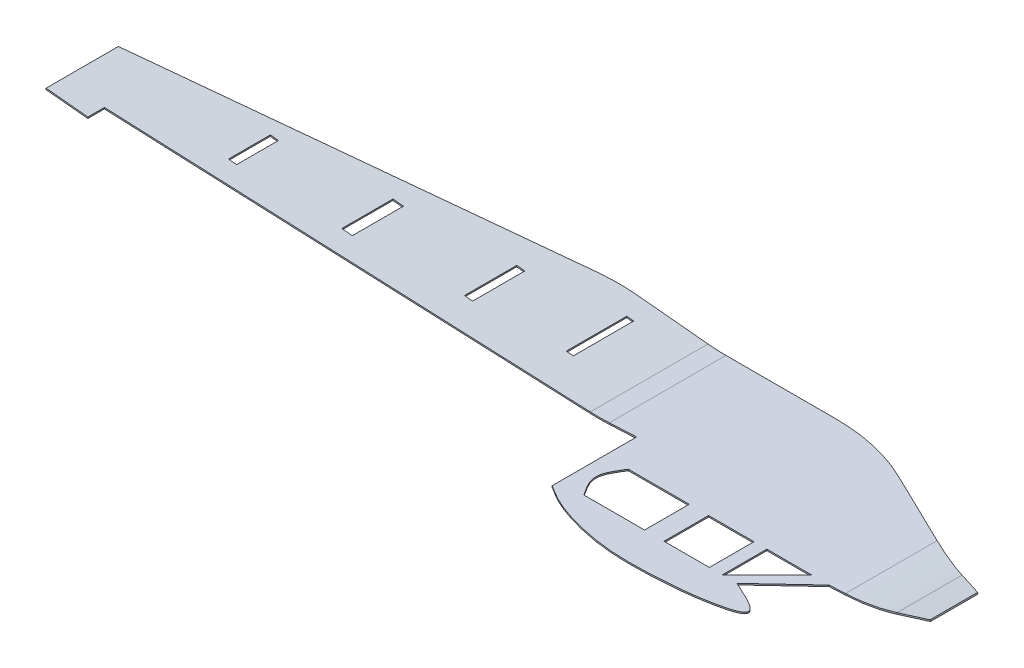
ISO-10303-21;
HEADER;
FILE_DESCRIPTION(('STEP AP214'),'2;1');
FILE_NAME('part.step','',(''),(''),'','','');
FILE_SCHEMA(('AUTOMOTIVE_DESIGN { 1 0 10303 214 1 1 1 1 }'));
ENDSEC;
DATA;
#1=APPLICATION_CONTEXT('core data for automotive mechanical design processes');
#2=APPLICATION_PROTOCOL_DEFINITION('international standard','automotive_design',2000,#1);
#3=PRODUCT_CONTEXT('',#1,'mechanical');
#4=PRODUCT('Part','Part','',(#3));
#5=PRODUCT_RELATED_PRODUCT_CATEGORY('part','',(#4));
#6=PRODUCT_DEFINITION_FORMATION('','',#4);
#7=PRODUCT_DEFINITION_CONTEXT('part definition',#1,'design');
#8=PRODUCT_DEFINITION('design','',#6,#7);
#9=PRODUCT_DEFINITION_SHAPE('','',#8);
#10=(LENGTH_UNIT() NAMED_UNIT(*) SI_UNIT(.MILLI.,.METRE.));
#11=(NAMED_UNIT(*) PLANE_ANGLE_UNIT() SI_UNIT($,.RADIAN.));
#12=(NAMED_UNIT(*) SI_UNIT($,.STERADIAN.) SOLID_ANGLE_UNIT());
#13=UNCERTAINTY_MEASURE_WITH_UNIT(LENGTH_MEASURE(1.E-05),#10,'distance_accuracy_value','');
#14=(GEOMETRIC_REPRESENTATION_CONTEXT(3) GLOBAL_UNCERTAINTY_ASSIGNED_CONTEXT((#13)) GLOBAL_UNIT_ASSIGNED_CONTEXT((#10,
#11,#12)) REPRESENTATION_CONTEXT('',''));
#15=CARTESIAN_POINT('',(0.,0.,0.));
#16=DIRECTION('',(0.,0.,1.));
#17=DIRECTION('',(1.,0.,0.));
#18=AXIS2_PLACEMENT_3D('',#15,#16,#17);
#19=CARTESIAN_POINT('',(564.796260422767,-54.5,250.));
#20=DIRECTION('',(0.,1.,0.));
#21=DIRECTION('',(0.,0.,1.));
#22=AXIS2_PLACEMENT_3D('',#19,#20,#21);
#23=PLANE('',#22);
#24=DIRECTION('',(1.,0.,0.));
#25=VECTOR('',#24,1.);
#26=CARTESIAN_POINT('',(564.796260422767,-54.5,208.037548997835));
#27=LINE('',#26,#25);
#28=CARTESIAN_POINT('',(754.759956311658,-54.5,208.037548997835));
#29=VERTEX_POINT('',#28);
#30=CARTESIAN_POINT('',(705.596552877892,-54.5,208.037548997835));
#31=VERTEX_POINT('',#30);
#32=EDGE_CURVE('E1037',#29,#31,#27,.F.);
#33=ORIENTED_EDGE('',*,*,#32,.T.);
#34=DIRECTION('',(0.,0.,1.));
#35=VECTOR('',#34,1.);
#36=CARTESIAN_POINT('',(705.596552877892,-54.5,250.));
#37=LINE('',#36,#35);
#38=CARTESIAN_POINT('',(705.596552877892,-54.5,159.682168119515));
#39=VERTEX_POINT('',#38);
#40=EDGE_CURVE('E1761',#31,#39,#37,.F.);
#41=ORIENTED_EDGE('',*,*,#40,.T.);
#42=DIRECTION('',(1.,0.,0.));
#43=VECTOR('',#42,1.);
#44=CARTESIAN_POINT('',(564.796260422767,-54.5,159.682168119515));
#45=LINE('',#44,#43);
#46=CARTESIAN_POINT('',(754.759956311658,-54.5,159.682168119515));
#47=VERTEX_POINT('',#46);
#48=EDGE_CURVE('E1757',#39,#47,#45,.T.);
#49=ORIENTED_EDGE('',*,*,#48,.T.);
#50=DIRECTION('',(0.,0.,1.));
#51=VECTOR('',#50,1.);
#52=CARTESIAN_POINT('',(754.759956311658,-54.5,250.));
#53=LINE('',#52,#51);
#54=EDGE_CURVE('E1754',#47,#29,#53,.T.);
#55=ORIENTED_EDGE('',*,*,#54,.T.);
#56=EDGE_LOOP('',(#33,#41,#49,#55));
#57=FACE_BOUND('',#56,.T.);
#58=DIRECTION('',(-0.707106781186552,0.,0.707106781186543));
#59=VECTOR('',#58,1.);
#60=CARTESIAN_POINT('',(817.092128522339,-54.5,159.682168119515));
#61=LINE('',#60,#59);
#62=CARTESIAN_POINT('',(817.092128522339,-54.5,159.682168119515));
#63=VERTEX_POINT('',#62);
#64=CARTESIAN_POINT('',(768.736747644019,-54.5,208.037548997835));
#65=VERTEX_POINT('',#64);
#66=EDGE_CURVE('E1042',#63,#65,#61,.T.);
#67=ORIENTED_EDGE('',*,*,#66,.T.);
#68=DIRECTION('',(0.,0.,1.));
#69=VECTOR('',#68,1.);
#70=CARTESIAN_POINT('',(768.736747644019,-54.5,250.));
#71=LINE('',#70,#69);
#72=CARTESIAN_POINT('',(768.736747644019,-54.5,159.682168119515));
#73=VERTEX_POINT('',#72);
#74=EDGE_CURVE('E1786',#65,#73,#71,.F.);
#75=ORIENTED_EDGE('',*,*,#74,.T.);
#76=DIRECTION('',(1.,0.,0.));
#77=VECTOR('',#76,1.);
#78=CARTESIAN_POINT('',(564.796260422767,-54.5,159.682168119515));
#79=LINE('',#78,#77);
#80=EDGE_CURVE('E1783',#73,#63,#79,.T.);
#81=ORIENTED_EDGE('',*,*,#80,.T.);
#82=EDGE_LOOP('',(#67,#75,#81));
#83=FACE_BOUND('',#82,.T.);
#84=DIRECTION('',(1.,0.,0.));
#85=VECTOR('',#84,1.);
#86=CARTESIAN_POINT('',(564.796260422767,-54.5,208.037548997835));
#87=LINE('',#86,#85);
#88=CARTESIAN_POINT('',(684.526522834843,-54.5,208.037548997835));
#89=VERTEX_POINT('',#88);
#90=CARTESIAN_POINT('',(618.682678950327,-54.5,208.037548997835));
#91=VERTEX_POINT('',#90);
#92=EDGE_CURVE('E947',#89,#91,#87,.F.);
#93=ORIENTED_EDGE('',*,*,#92,.T.);
#94=CARTESIAN_POINT('',(618.682678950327,-54.5,208.037548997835));
#95=CARTESIAN_POINT('',(613.57271675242,-54.5,200.461724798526));
#96=CARTESIAN_POINT('',(602.849097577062,-54.5,184.563318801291));
#97=CARTESIAN_POINT('',(613.242096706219,-54.5,168.231588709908));
#98=CARTESIAN_POINT('',(618.682678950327,-54.5,159.682168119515));
#99=B_SPLINE_CURVE_WITH_KNOTS('',3,(#94,#95,#96,#97,#98),.UNSPECIFIED.,.F.,.F.,(4,1,4),(0.,
0.47651470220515,1.),.UNSPECIFIED.);
#100=CARTESIAN_POINT('',(618.682678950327,-54.5,159.682168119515));
#101=VERTEX_POINT('',#100);
#102=EDGE_CURVE('E953',#91,#101,#99,.T.);
#103=ORIENTED_EDGE('',*,*,#102,.T.);
#104=DIRECTION('',(1.,0.,0.));
#105=VECTOR('',#104,1.);
#106=CARTESIAN_POINT('',(564.796260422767,-54.5,159.682168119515));
#107=LINE('',#106,#105);
#108=CARTESIAN_POINT('',(684.526522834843,-54.5,159.682168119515));
#109=VERTEX_POINT('',#108);
#110=EDGE_CURVE('E949',#101,#109,#107,.T.);
#111=ORIENTED_EDGE('',*,*,#110,.T.);
#112=DIRECTION('',(0.,0.,1.));
#113=VECTOR('',#112,1.);
#114=CARTESIAN_POINT('',(684.526522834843,-54.5,250.));
#115=LINE('',#114,#113);
#116=EDGE_CURVE('E944',#109,#89,#115,.T.);
#117=ORIENTED_EDGE('',*,*,#116,.T.);
#118=EDGE_LOOP('',(#93,#103,#111,#117));
#119=FACE_BOUND('',#118,.T.);
#120=DIRECTION('',(0.,0.,-1.));
#121=VECTOR('',#120,1.);
#122=CARTESIAN_POINT('',(564.796260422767,-54.5,250.));
#123=LINE('',#122,#121);
#124=CARTESIAN_POINT('',(564.796260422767,-54.5,126.484307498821));
#125=VERTEX_POINT('',#124);
#126=CARTESIAN_POINT('',(564.796260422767,-54.5000003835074,0.));
#127=VERTEX_POINT('',#126);
#128=EDGE_CURVE('E391',#125,#127,#123,.T.);
#129=ORIENTED_EDGE('',*,*,#128,.F.);
#130=DIRECTION('',(-0.998604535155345,0.,0.052810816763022));
#131=VECTOR('',#130,1.);
#132=CARTESIAN_POINT('',(42.8423012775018,-54.4999999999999,154.087641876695));
#133=LINE('',#132,#131);
#134=CARTESIAN_POINT('',(592.863165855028,-54.5,125.));
#135=VERTEX_POINT('',#134);
#136=EDGE_CURVE('E775',#135,#125,#133,.T.);
#137=ORIENTED_EDGE('',*,*,#136,.F.);
#138=DIRECTION('',(0.,0.,1.));
#139=VECTOR('',#138,1.);
#140=CARTESIAN_POINT('',(592.863165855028,-54.5,250.));
#141=LINE('',#140,#139);
#142=CARTESIAN_POINT('',(592.863165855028,-54.5,216.493855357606));
#143=VERTEX_POINT('',#142);
#144=EDGE_CURVE('E770',#143,#135,#141,.F.);
#145=ORIENTED_EDGE('',*,*,#144,.F.);
#146=CARTESIAN_POINT('',(784.609165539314,-54.5,208.037548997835));
#147=CARTESIAN_POINT('',(801.872460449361,-54.5,215.648838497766));
#148=CARTESIAN_POINT('',(834.486945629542,-54.5,230.028381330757));
#149=CARTESIAN_POINT('',(780.197692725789,-54.5,242.119856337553));
#150=CARTESIAN_POINT('',(741.470014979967,-54.5,245.787594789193));
#151=CARTESIAN_POINT('',(690.386505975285,-54.5,248.403230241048));
#152=CARTESIAN_POINT('',(643.672839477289,-54.5,239.731915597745));
#153=CARTESIAN_POINT('',(612.709471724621,-54.5,229.024921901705));
#154=CARTESIAN_POINT('',(597.884606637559,-54.5,219.664420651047));
#155=CARTESIAN_POINT('',(592.863165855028,-54.5,216.493855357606));
#156=B_SPLINE_CURVE_WITH_KNOTS('',3,(#146,#147,#148,#149,#150,#151,#152,#153,#154,#155),
.UNSPECIFIED.,.F.,.F.,(4,1,1,1,1,1,1,4),(0.,0.143069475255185,0.270292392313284,
0.404283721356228,0.641121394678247,0.805930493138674,0.934265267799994,1.),.UNSPECIFIED.);
#157=CARTESIAN_POINT('',(784.609165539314,-54.5,208.037548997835));
#158=VERTEX_POINT('',#157);
#159=EDGE_CURVE('E765',#158,#143,#156,.T.);
#160=ORIENTED_EDGE('',*,*,#159,.F.);
#161=DIRECTION('',(-0.729322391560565,0.,0.684170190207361));
#162=VECTOR('',#161,1.);
#163=CARTESIAN_POINT('',(836.155787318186,-54.5,159.682168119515));
#164=LINE('',#163,#162);
#165=CARTESIAN_POINT('',(836.155787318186,-54.5,159.682168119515));
#166=VERTEX_POINT('',#165);
#167=EDGE_CURVE('E756',#166,#158,#164,.T.);
#168=ORIENTED_EDGE('',*,*,#167,.F.);
#169=DIRECTION('',(-0.998604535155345,0.,0.0528108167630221));
#170=VECTOR('',#169,1.);
#171=CARTESIAN_POINT('',(941.943192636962,-54.5000000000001,154.087641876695));
#172=LINE('',#171,#170);
#173=CARTESIAN_POINT('',(853.001144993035,-54.5,158.791307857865));
#174=VERTEX_POINT('',#173);
#175=EDGE_CURVE('E763',#174,#166,#172,.T.);
#176=ORIENTED_EDGE('',*,*,#175,.F.);
#177=DIRECTION('',(0.,0.,-1.));
#178=VECTOR('',#177,1.);
#179=CARTESIAN_POINT('',(853.001144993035,-54.5,250.));
#180=LINE('',#179,#178);
#181=CARTESIAN_POINT('',(853.001144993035,-54.5000005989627,59.4274809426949));
#182=VERTEX_POINT('',#181);
#183=EDGE_CURVE('E889',#174,#182,#180,.T.);
#184=ORIENTED_EDGE('',*,*,#183,.T.);
#185=DIRECTION('',(0.899902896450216,0.,0.436090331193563));
#186=VECTOR('',#185,1.);
#187=CARTESIAN_POINT('',(771.679856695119,-54.5,20.019420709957));
#188=LINE('',#187,#186);
#189=CARTESIAN_POINT('',(771.679856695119,-54.5,20.019420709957));
#190=VERTEX_POINT('',#189);
#191=EDGE_CURVE('E925',#190,#182,#188,.T.);
#192=ORIENTED_EDGE('',*,*,#191,.F.);
#193=CARTESIAN_POINT('',(684.461790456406,-54.5,200.));
#194=DIRECTION('',(0.,-1.,0.));
#195=DIRECTION('',(1.,0.,0.));
#196=AXIS2_PLACEMENT_3D('',#193,#194,#195);
#197=CIRCLE('',#196,200.);
#198=CARTESIAN_POINT('',(684.461790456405,-54.5,0.));
#199=VERTEX_POINT('',#198);
#200=EDGE_CURVE('E936',#199,#190,#197,.T.);
#201=ORIENTED_EDGE('',*,*,#200,.F.);
#202=DIRECTION('',(1.,0.,0.));
#203=VECTOR('',#202,1.);
#204=CARTESIAN_POINT('',(564.796260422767,-54.5,0.));
#205=LINE('',#204,#203);
#206=EDGE_CURVE('E1048',#127,#199,#205,.T.);
#207=ORIENTED_EDGE('',*,*,#206,.F.);
#208=EDGE_LOOP('',(#129,#137,#145,#160,#168,#176,#184,#192,#201,#207));
#209=FACE_BOUND('',#208,.T.);
#210=ADVANCED_FACE('F56',(#57,#83,#119,#209),#23,.T.);
#211=CARTESIAN_POINT('',(564.796260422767,-56.,250.));
#212=DIRECTION('',(0.,1.,0.));
#213=DIRECTION('',(0.,0.,1.));
#214=AXIS2_PLACEMENT_3D('',#211,#212,#213);
#215=PLANE('',#214);
#216=DIRECTION('',(0.,0.,-1.));
#217=VECTOR('',#216,1.);
#218=CARTESIAN_POINT('',(705.596552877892,-56.,208.037548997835));
#219=LINE('',#218,#217);
#220=CARTESIAN_POINT('',(705.596552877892,-56.,208.037548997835));
#221=VERTEX_POINT('',#220);
#222=CARTESIAN_POINT('',(705.596552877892,-56.,159.682168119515));
#223=VERTEX_POINT('',#222);
#224=EDGE_CURVE('E1769',#221,#223,#219,.T.);
#225=ORIENTED_EDGE('',*,*,#224,.F.);
#226=DIRECTION('',(-1.,0.,0.));
#227=VECTOR('',#226,1.);
#228=CARTESIAN_POINT('',(754.759956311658,-56.,208.037548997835));
#229=LINE('',#228,#227);
#230=CARTESIAN_POINT('',(754.759956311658,-56.,208.037548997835));
#231=VERTEX_POINT('',#230);
#232=EDGE_CURVE('E1767',#231,#221,#229,.T.);
#233=ORIENTED_EDGE('',*,*,#232,.F.);
#234=DIRECTION('',(0.,0.,1.));
#235=VECTOR('',#234,1.);
#236=CARTESIAN_POINT('',(754.759956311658,-56.,208.037548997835));
#237=LINE('',#236,#235);
#238=CARTESIAN_POINT('',(754.759956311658,-56.,159.682168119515));
#239=VERTEX_POINT('',#238);
#240=EDGE_CURVE('E1764',#239,#231,#237,.T.);
#241=ORIENTED_EDGE('',*,*,#240,.F.);
#242=DIRECTION('',(1.,0.,0.));
#243=VECTOR('',#242,1.);
#244=CARTESIAN_POINT('',(754.759956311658,-56.,159.682168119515));
#245=LINE('',#244,#243);
#246=EDGE_CURVE('E1756',#223,#239,#245,.T.);
#247=ORIENTED_EDGE('',*,*,#246,.F.);
#248=EDGE_LOOP('',(#225,#233,#241,#247));
#249=FACE_BOUND('',#248,.T.);
#250=DIRECTION('',(0.,0.,-1.));
#251=VECTOR('',#250,1.);
#252=CARTESIAN_POINT('',(768.736747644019,-56.,208.037548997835));
#253=LINE('',#252,#251);
#254=CARTESIAN_POINT('',(768.736747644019,-56.,208.037548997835));
#255=VERTEX_POINT('',#254);
#256=CARTESIAN_POINT('',(768.736747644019,-56.,159.682168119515));
#257=VERTEX_POINT('',#256);
#258=EDGE_CURVE('E1785',#255,#257,#253,.T.);
#259=ORIENTED_EDGE('',*,*,#258,.F.);
#260=DIRECTION('',(-0.707106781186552,0.,0.707106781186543));
#261=VECTOR('',#260,1.);
#262=CARTESIAN_POINT('',(817.092128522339,-56.,159.682168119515));
#263=LINE('',#262,#261);
#264=CARTESIAN_POINT('',(817.092128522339,-56.,159.682168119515));
#265=VERTEX_POINT('',#264);
#266=EDGE_CURVE('E1791',#265,#255,#263,.T.);
#267=ORIENTED_EDGE('',*,*,#266,.F.);
#268=DIRECTION('',(1.,0.,0.));
#269=VECTOR('',#268,1.);
#270=CARTESIAN_POINT('',(768.736747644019,-56.,159.682168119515));
#271=LINE('',#270,#269);
#272=EDGE_CURVE('E1780',#257,#265,#271,.T.);
#273=ORIENTED_EDGE('',*,*,#272,.F.);
#274=EDGE_LOOP('',(#259,#267,#273));
#275=FACE_BOUND('',#274,.T.);
#276=CARTESIAN_POINT('',(618.682678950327,-56.,208.037548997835));
#277=CARTESIAN_POINT('',(613.57271675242,-56.,200.461724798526));
#278=CARTESIAN_POINT('',(602.849097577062,-56.,184.563318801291));
#279=CARTESIAN_POINT('',(613.242096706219,-56.,168.231588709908));
#280=CARTESIAN_POINT('',(618.682678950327,-56.,159.682168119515));
#281=B_SPLINE_CURVE_WITH_KNOTS('',3,(#276,#277,#278,#279,#280),.UNSPECIFIED.,.F.,.F.,(4,1,4),
(0.,0.47651470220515,1.),.UNSPECIFIED.);
#282=CARTESIAN_POINT('',(618.682678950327,-56.,208.037548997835));
#283=VERTEX_POINT('',#282);
#284=CARTESIAN_POINT('',(618.682678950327,-56.,159.682168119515));
#285=VERTEX_POINT('',#284);
#286=EDGE_CURVE('E967',#283,#285,#281,.T.);
#287=ORIENTED_EDGE('',*,*,#286,.F.);
#288=DIRECTION('',(-1.,0.,0.));
#289=VECTOR('',#288,1.);
#290=CARTESIAN_POINT('',(684.526522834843,-56.,208.037548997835));
#291=LINE('',#290,#289);
#292=CARTESIAN_POINT('',(684.526522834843,-56.,208.037548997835));
#293=VERTEX_POINT('',#292);
#294=EDGE_CURVE('E965',#293,#283,#291,.T.);
#295=ORIENTED_EDGE('',*,*,#294,.F.);
#296=DIRECTION('',(0.,0.,1.));
#297=VECTOR('',#296,1.);
#298=CARTESIAN_POINT('',(684.526522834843,-56.,208.037548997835));
#299=LINE('',#298,#297);
#300=CARTESIAN_POINT('',(684.526522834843,-56.,159.682168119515));
#301=VERTEX_POINT('',#300);
#302=EDGE_CURVE('E943',#301,#293,#299,.T.);
#303=ORIENTED_EDGE('',*,*,#302,.F.);
#304=DIRECTION('',(1.,0.,0.));
#305=VECTOR('',#304,1.);
#306=CARTESIAN_POINT('',(684.526522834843,-56.,159.682168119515));
#307=LINE('',#306,#305);
#308=EDGE_CURVE('E948',#285,#301,#307,.T.);
#309=ORIENTED_EDGE('',*,*,#308,.F.);
#310=EDGE_LOOP('',(#287,#295,#303,#309));
#311=FACE_BOUND('',#310,.T.);
#312=DIRECTION('',(-0.998604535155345,0.,0.052810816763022));
#313=VECTOR('',#312,1.);
#314=CARTESIAN_POINT('',(42.8423012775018,-55.9999999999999,154.087641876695));
#315=LINE('',#314,#313);
#316=CARTESIAN_POINT('',(592.863165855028,-56.,125.));
#317=VERTEX_POINT('',#316);
#318=CARTESIAN_POINT('',(564.796260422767,-56.,126.484307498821));
#319=VERTEX_POINT('',#318);
#320=EDGE_CURVE('E72',#317,#319,#315,.T.);
#321=ORIENTED_EDGE('',*,*,#320,.T.);
#322=DIRECTION('',(0.,0.,-1.));
#323=VECTOR('',#322,1.);
#324=CARTESIAN_POINT('',(564.796260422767,-56.,250.));
#325=LINE('',#324,#323);
#326=CARTESIAN_POINT('',(564.796260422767,-56.,0.));
#327=VERTEX_POINT('',#326);
#328=EDGE_CURVE('E65',#319,#327,#325,.T.);
#329=ORIENTED_EDGE('',*,*,#328,.T.);
#330=DIRECTION('',(1.,0.,0.));
#331=VECTOR('',#330,1.);
#332=CARTESIAN_POINT('',(564.796260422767,-56.,0.));
#333=LINE('',#332,#331);
#334=CARTESIAN_POINT('',(684.461790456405,-56.,0.));
#335=VERTEX_POINT('',#334);
#336=EDGE_CURVE('E80',#327,#335,#333,.T.);
#337=ORIENTED_EDGE('',*,*,#336,.T.);
#338=CARTESIAN_POINT('',(684.461790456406,-56.,200.));
#339=DIRECTION('',(0.,-1.,0.));
#340=DIRECTION('',(1.,0.,0.));
#341=AXIS2_PLACEMENT_3D('',#338,#339,#340);
#342=CIRCLE('',#341,200.);
#343=CARTESIAN_POINT('',(771.679856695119,-56.,20.019420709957));
#344=VERTEX_POINT('',#343);
#345=EDGE_CURVE('E922',#335,#344,#342,.T.);
#346=ORIENTED_EDGE('',*,*,#345,.T.);
#347=DIRECTION('',(0.899902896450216,0.,0.436090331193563));
#348=VECTOR('',#347,1.);
#349=CARTESIAN_POINT('',(771.679856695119,-56.,20.019420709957));
#350=LINE('',#349,#348);
#351=CARTESIAN_POINT('',(853.001144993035,-56.,59.4274809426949));
#352=VERTEX_POINT('',#351);
#353=EDGE_CURVE('E921',#344,#352,#350,.T.);
#354=ORIENTED_EDGE('',*,*,#353,.T.);
#355=DIRECTION('',(0.,0.,-1.));
#356=VECTOR('',#355,1.);
#357=CARTESIAN_POINT('',(853.001144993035,-56.,250.));
#358=LINE('',#357,#356);
#359=CARTESIAN_POINT('',(853.001144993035,-56.,158.791307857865));
#360=VERTEX_POINT('',#359);
#361=EDGE_CURVE('E908',#360,#352,#358,.T.);
#362=ORIENTED_EDGE('',*,*,#361,.F.);
#363=DIRECTION('',(-0.998604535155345,0.,0.0528108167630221));
#364=VECTOR('',#363,1.);
#365=CARTESIAN_POINT('',(941.943192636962,-56.0000000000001,154.087641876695));
#366=LINE('',#365,#364);
#367=CARTESIAN_POINT('',(836.155787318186,-56.,159.682168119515));
#368=VERTEX_POINT('',#367);
#369=EDGE_CURVE('E779',#360,#368,#366,.T.);
#370=ORIENTED_EDGE('',*,*,#369,.T.);
#371=DIRECTION('',(-0.729322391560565,0.,0.684170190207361));
#372=VECTOR('',#371,1.);
#373=CARTESIAN_POINT('',(836.155787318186,-56.,159.682168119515));
#374=LINE('',#373,#372);
#375=CARTESIAN_POINT('',(784.609165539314,-56.,208.037548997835));
#376=VERTEX_POINT('',#375);
#377=EDGE_CURVE('E776',#368,#376,#374,.T.);
#378=ORIENTED_EDGE('',*,*,#377,.T.);
#379=CARTESIAN_POINT('',(784.609165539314,-56.,208.037548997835));
#380=CARTESIAN_POINT('',(801.872460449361,-56.,215.648838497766));
#381=CARTESIAN_POINT('',(834.486945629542,-56.,230.028381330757));
#382=CARTESIAN_POINT('',(780.197692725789,-56.,242.119856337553));
#383=CARTESIAN_POINT('',(741.470014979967,-56.,245.787594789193));
#384=CARTESIAN_POINT('',(690.386505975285,-56.,248.403230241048));
#385=CARTESIAN_POINT('',(643.672839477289,-56.,239.731915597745));
#386=CARTESIAN_POINT('',(612.709471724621,-56.,229.024921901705));
#387=CARTESIAN_POINT('',(597.884606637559,-56.,219.664420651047));
#388=CARTESIAN_POINT('',(592.863165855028,-56.,216.493855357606));
#389=B_SPLINE_CURVE_WITH_KNOTS('',3,(#379,#380,#381,#382,#383,#384,#385,#386,#387,#388),
.UNSPECIFIED.,.F.,.F.,(4,1,1,1,1,1,1,4),(0.,0.143069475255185,0.270292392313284,
0.404283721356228,0.641121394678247,0.805930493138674,0.934265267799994,1.),.UNSPECIFIED.);
#390=CARTESIAN_POINT('',(592.863165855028,-56.,216.493855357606));
#391=VERTEX_POINT('',#390);
#392=EDGE_CURVE('E764',#376,#391,#389,.T.);
#393=ORIENTED_EDGE('',*,*,#392,.T.);
#394=DIRECTION('',(0.,0.,-1.));
#395=VECTOR('',#394,1.);
#396=CARTESIAN_POINT('',(592.863165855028,-56.,125.));
#397=LINE('',#396,#395);
#398=EDGE_CURVE('E780',#391,#317,#397,.T.);
#399=ORIENTED_EDGE('',*,*,#398,.T.);
#400=EDGE_LOOP('',(#321,#329,#337,#346,#354,#362,#370,#378,#393,#399));
#401=FACE_BOUND('',#400,.T.);
#402=ADVANCED_FACE('F1026',(#249,#275,#311,#401),#215,.F.);
#403=CARTESIAN_POINT('',(906.430176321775,-48.7873866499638,0.));
#404=DIRECTION('',(0.,0.,-1.));
#405=DIRECTION('',(-1.,0.,0.));
#406=AXIS2_PLACEMENT_3D('',#403,#404,#405);
#407=PLANE('',#406);
#408=ORIENTED_EDGE('',*,*,#206,.T.);
#409=DIRECTION('',(0.,-1.,0.));
#410=VECTOR('',#409,1.);
#411=CARTESIAN_POINT('',(684.461790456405,-56.,0.));
#412=LINE('',#411,#410);
#413=EDGE_CURVE('E937',#335,#199,#412,.F.);
#414=ORIENTED_EDGE('',*,*,#413,.F.);
#415=ORIENTED_EDGE('',*,*,#336,.F.);
#416=DIRECTION('',(0.,1.,0.));
#417=VECTOR('',#416,1.);
#418=CARTESIAN_POINT('',(564.796260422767,-56.,0.));
#419=LINE('',#418,#417);
#420=EDGE_CURVE('E646',#327,#127,#419,.T.);
#421=ORIENTED_EDGE('',*,*,#420,.T.);
#422=EDGE_LOOP('',(#408,#414,#415,#421));
#423=FACE_BOUND('',#422,.T.);
#424=ADVANCED_FACE('F58',(#423),#407,.T.);
#425=CARTESIAN_POINT('',(768.736747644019,-56.,208.037548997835));
#426=DIRECTION('',(1.,0.,0.));
#427=DIRECTION('',(0.,0.,-1.));
#428=AXIS2_PLACEMENT_3D('',#425,#426,#427);
#429=PLANE('',#428);
#430=DIRECTION('',(0.,-1.,0.));
#431=VECTOR('',#430,1.);
#432=CARTESIAN_POINT('',(768.736747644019,-56.,208.037548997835));
#433=LINE('',#432,#431);
#434=EDGE_CURVE('E1149',#255,#65,#433,.F.);
#435=ORIENTED_EDGE('',*,*,#434,.F.);
#436=ORIENTED_EDGE('',*,*,#258,.T.);
#437=DIRECTION('',(0.,-1.,0.));
#438=VECTOR('',#437,1.);
#439=CARTESIAN_POINT('',(768.736747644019,-56.,159.682168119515));
#440=LINE('',#439,#438);
#441=EDGE_CURVE('E1152',#257,#73,#440,.F.);
#442=ORIENTED_EDGE('',*,*,#441,.T.);
#443=ORIENTED_EDGE('',*,*,#74,.F.);
#444=EDGE_LOOP('',(#435,#436,#442,#443));
#445=FACE_BOUND('',#444,.T.);
#446=ADVANCED_FACE('F1018',(#445),#429,.T.);
#447=CARTESIAN_POINT('',(768.736747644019,-56.,159.682168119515));
#448=DIRECTION('',(0.,0.,1.));
#449=DIRECTION('',(1.,0.,0.));
#450=AXIS2_PLACEMENT_3D('',#447,#448,#449);
#451=PLANE('',#450);
#452=ORIENTED_EDGE('',*,*,#441,.F.);
#453=ORIENTED_EDGE('',*,*,#272,.T.);
#454=DIRECTION('',(0.,-1.,0.));
#455=VECTOR('',#454,1.);
#456=CARTESIAN_POINT('',(817.092128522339,-56.,159.682168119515));
#457=LINE('',#456,#455);
#458=EDGE_CURVE('E1155',#265,#63,#457,.F.);
#459=ORIENTED_EDGE('',*,*,#458,.T.);
#460=ORIENTED_EDGE('',*,*,#80,.F.);
#461=EDGE_LOOP('',(#452,#453,#459,#460));
#462=FACE_BOUND('',#461,.T.);
#463=ADVANCED_FACE('F1015',(#462),#451,.T.);
#464=CARTESIAN_POINT('',(817.092128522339,-56.,159.682168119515));
#465=DIRECTION('',(-0.707106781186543,0.,-0.707106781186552));
#466=DIRECTION('',(-0.707106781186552,0.,0.707106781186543));
#467=AXIS2_PLACEMENT_3D('',#464,#465,#466);
#468=PLANE('',#467);
#469=ORIENTED_EDGE('',*,*,#266,.T.);
#470=ORIENTED_EDGE('',*,*,#434,.T.);
#471=ORIENTED_EDGE('',*,*,#66,.F.);
#472=ORIENTED_EDGE('',*,*,#458,.F.);
#473=EDGE_LOOP('',(#469,#470,#471,#472));
#474=FACE_BOUND('',#473,.T.);
#475=ADVANCED_FACE('F1010',(#474),#468,.T.);
#476=CARTESIAN_POINT('',(705.596552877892,-56.,208.037548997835));
#477=DIRECTION('',(1.,0.,0.));
#478=DIRECTION('',(0.,0.,-1.));
#479=AXIS2_PLACEMENT_3D('',#476,#477,#478);
#480=PLANE('',#479);
#481=DIRECTION('',(0.,-1.,0.));
#482=VECTOR('',#481,1.);
#483=CARTESIAN_POINT('',(705.596552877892,-56.,208.037548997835));
#484=LINE('',#483,#482);
#485=EDGE_CURVE('E1778',#221,#31,#484,.F.);
#486=ORIENTED_EDGE('',*,*,#485,.F.);
#487=ORIENTED_EDGE('',*,*,#224,.T.);
#488=DIRECTION('',(0.,-1.,0.));
#489=VECTOR('',#488,1.);
#490=CARTESIAN_POINT('',(705.596552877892,-56.,159.682168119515));
#491=LINE('',#490,#489);
#492=EDGE_CURVE('E1775',#223,#39,#491,.F.);
#493=ORIENTED_EDGE('',*,*,#492,.T.);
#494=ORIENTED_EDGE('',*,*,#40,.F.);
#495=EDGE_LOOP('',(#486,#487,#493,#494));
#496=FACE_BOUND('',#495,.T.);
#497=ADVANCED_FACE('F1006',(#496),#480,.T.);
#498=CARTESIAN_POINT('',(754.759956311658,-56.,159.682168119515));
#499=DIRECTION('',(0.,0.,1.));
#500=DIRECTION('',(1.,0.,0.));
#501=AXIS2_PLACEMENT_3D('',#498,#499,#500);
#502=PLANE('',#501);
#503=ORIENTED_EDGE('',*,*,#492,.F.);
#504=ORIENTED_EDGE('',*,*,#246,.T.);
#505=DIRECTION('',(0.,-1.,0.));
#506=VECTOR('',#505,1.);
#507=CARTESIAN_POINT('',(754.759956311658,-56.,159.682168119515));
#508=LINE('',#507,#506);
#509=EDGE_CURVE('E1772',#239,#47,#508,.F.);
#510=ORIENTED_EDGE('',*,*,#509,.T.);
#511=ORIENTED_EDGE('',*,*,#48,.F.);
#512=EDGE_LOOP('',(#503,#504,#510,#511));
#513=FACE_BOUND('',#512,.T.);
#514=ADVANCED_FACE('F1002',(#513),#502,.T.);
#515=CARTESIAN_POINT('',(754.759956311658,-56.,208.037548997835));
#516=DIRECTION('',(-1.,0.,0.));
#517=DIRECTION('',(0.,0.,1.));
#518=AXIS2_PLACEMENT_3D('',#515,#516,#517);
#519=PLANE('',#518);
#520=ORIENTED_EDGE('',*,*,#509,.F.);
#521=ORIENTED_EDGE('',*,*,#240,.T.);
#522=DIRECTION('',(0.,-1.,0.));
#523=VECTOR('',#522,1.);
#524=CARTESIAN_POINT('',(754.759956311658,-56.,208.037548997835));
#525=LINE('',#524,#523);
#526=EDGE_CURVE('E1760',#231,#29,#525,.F.);
#527=ORIENTED_EDGE('',*,*,#526,.T.);
#528=ORIENTED_EDGE('',*,*,#54,.F.);
#529=EDGE_LOOP('',(#520,#521,#527,#528));
#530=FACE_BOUND('',#529,.T.);
#531=ADVANCED_FACE('F999',(#530),#519,.T.);
#532=CARTESIAN_POINT('',(754.759956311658,-56.,208.037548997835));
#533=DIRECTION('',(0.,0.,-1.));
#534=DIRECTION('',(-1.,0.,0.));
#535=AXIS2_PLACEMENT_3D('',#532,#533,#534);
#536=PLANE('',#535);
#537=ORIENTED_EDGE('',*,*,#232,.T.);
#538=ORIENTED_EDGE('',*,*,#485,.T.);
#539=ORIENTED_EDGE('',*,*,#32,.F.);
#540=ORIENTED_EDGE('',*,*,#526,.F.);
#541=EDGE_LOOP('',(#537,#538,#539,#540));
#542=FACE_BOUND('',#541,.T.);
#543=ADVANCED_FACE('F990',(#542),#536,.T.);
#544=CARTESIAN_POINT('',(618.682678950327,-56.,208.037548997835));
#545=CARTESIAN_POINT('',(613.57271675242,-56.,200.461724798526));
#546=CARTESIAN_POINT('',(602.849097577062,-56.,184.563318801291));
#547=CARTESIAN_POINT('',(613.242096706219,-56.,168.231588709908));
#548=CARTESIAN_POINT('',(618.682678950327,-56.,159.682168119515));
#549=B_SPLINE_CURVE_WITH_KNOTS('',3,(#544,#545,#546,#547,#548),.UNSPECIFIED.,.F.,.F.,(4,1,4),
(0.,0.47651470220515,1.),.UNSPECIFIED.);
#550=DIRECTION('',(0.,1.,0.));
#551=VECTOR('',#550,1.);
#552=SURFACE_OF_LINEAR_EXTRUSION('',#549,#551);
#553=DIRECTION('',(0.,-1.,0.));
#554=VECTOR('',#553,1.);
#555=CARTESIAN_POINT('',(618.682678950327,-56.,208.037548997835));
#556=LINE('',#555,#554);
#557=EDGE_CURVE('E1745',#283,#91,#556,.F.);
#558=ORIENTED_EDGE('',*,*,#557,.F.);
#559=ORIENTED_EDGE('',*,*,#286,.T.);
#560=DIRECTION('',(0.,-1.,0.));
#561=VECTOR('',#560,1.);
#562=CARTESIAN_POINT('',(618.682678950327,-56.,159.682168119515));
#563=LINE('',#562,#561);
#564=EDGE_CURVE('E1740',#285,#101,#563,.F.);
#565=ORIENTED_EDGE('',*,*,#564,.T.);
#566=ORIENTED_EDGE('',*,*,#102,.F.);
#567=EDGE_LOOP('',(#558,#559,#565,#566));
#568=FACE_BOUND('',#567,.T.);
#569=ADVANCED_FACE('F985',(#568),#552,.T.);
#570=CARTESIAN_POINT('',(684.526522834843,-56.,159.682168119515));
#571=DIRECTION('',(0.,0.,1.));
#572=DIRECTION('',(1.,0.,0.));
#573=AXIS2_PLACEMENT_3D('',#570,#571,#572);
#574=PLANE('',#573);
#575=ORIENTED_EDGE('',*,*,#564,.F.);
#576=ORIENTED_EDGE('',*,*,#308,.T.);
#577=DIRECTION('',(0.,-1.,0.));
#578=VECTOR('',#577,1.);
#579=CARTESIAN_POINT('',(684.526522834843,-56.,159.682168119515));
#580=LINE('',#579,#578);
#581=EDGE_CURVE('E979',#301,#109,#580,.F.);
#582=ORIENTED_EDGE('',*,*,#581,.T.);
#583=ORIENTED_EDGE('',*,*,#110,.F.);
#584=EDGE_LOOP('',(#575,#576,#582,#583));
#585=FACE_BOUND('',#584,.T.);
#586=ADVANCED_FACE('F989',(#585),#574,.T.);
#587=CARTESIAN_POINT('',(684.526522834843,-56.,208.037548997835));
#588=DIRECTION('',(-1.,0.,0.));
#589=DIRECTION('',(0.,0.,1.));
#590=AXIS2_PLACEMENT_3D('',#587,#588,#589);
#591=PLANE('',#590);
#592=ORIENTED_EDGE('',*,*,#581,.F.);
#593=ORIENTED_EDGE('',*,*,#302,.T.);
#594=DIRECTION('',(0.,-1.,0.));
#595=VECTOR('',#594,1.);
#596=CARTESIAN_POINT('',(684.526522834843,-56.,208.037548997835));
#597=LINE('',#596,#595);
#598=EDGE_CURVE('E952',#293,#89,#597,.F.);
#599=ORIENTED_EDGE('',*,*,#598,.T.);
#600=ORIENTED_EDGE('',*,*,#116,.F.);
#601=EDGE_LOOP('',(#592,#593,#599,#600));
#602=FACE_BOUND('',#601,.T.);
#603=ADVANCED_FACE('F997',(#602),#591,.T.);
#604=CARTESIAN_POINT('',(684.526522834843,-56.,208.037548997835));
#605=DIRECTION('',(0.,0.,-1.));
#606=DIRECTION('',(-1.,0.,0.));
#607=AXIS2_PLACEMENT_3D('',#604,#605,#606);
#608=PLANE('',#607);
#609=ORIENTED_EDGE('',*,*,#294,.T.);
#610=ORIENTED_EDGE('',*,*,#557,.T.);
#611=ORIENTED_EDGE('',*,*,#92,.F.);
#612=ORIENTED_EDGE('',*,*,#598,.F.);
#613=EDGE_LOOP('',(#609,#610,#611,#612));
#614=FACE_BOUND('',#613,.T.);
#615=ADVANCED_FACE('F993',(#614),#608,.T.);
#616=CARTESIAN_POINT('',(684.461790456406,-56.,200.));
#617=DIRECTION('',(0.,-1.,0.));
#618=DIRECTION('',(1.,0.,0.));
#619=AXIS2_PLACEMENT_3D('',#616,#617,#618);
#620=CYLINDRICAL_SURFACE('',#619,200.);
#621=DIRECTION('',(0.,-1.,0.));
#622=VECTOR('',#621,1.);
#623=CARTESIAN_POINT('',(771.679856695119,-56.,20.019420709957));
#624=LINE('',#623,#622);
#625=EDGE_CURVE('E940',#344,#190,#624,.F.);
#626=ORIENTED_EDGE('',*,*,#625,.F.);
#627=ORIENTED_EDGE('',*,*,#345,.F.);
#628=ORIENTED_EDGE('',*,*,#413,.T.);
#629=ORIENTED_EDGE('',*,*,#200,.T.);
#630=EDGE_LOOP('',(#626,#627,#628,#629));
#631=FACE_BOUND('',#630,.T.);
#632=ADVANCED_FACE('F996',(#631),#620,.T.);
#633=CARTESIAN_POINT('',(771.679856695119,-56.,20.019420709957));
#634=DIRECTION('',(-0.436090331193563,0.,0.899902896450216));
#635=DIRECTION('',(0.899902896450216,0.,0.436090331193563));
#636=AXIS2_PLACEMENT_3D('',#633,#634,#635);
#637=PLANE('',#636);
#638=ORIENTED_EDGE('',*,*,#353,.F.);
#639=ORIENTED_EDGE('',*,*,#625,.T.);
#640=ORIENTED_EDGE('',*,*,#191,.T.);
#641=CARTESIAN_POINT('',(853.001144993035,-56.0000005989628,59.4274809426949));
#642=CARTESIAN_POINT('',(853.001144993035,-54.5000005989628,59.4274809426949));
#643=B_SPLINE_CURVE_WITH_KNOTS('',1,(#641,#642),.UNSPECIFIED.,.F.,.F.,(2,2),(0.,1.),.UNSPECIFIED.);
#644=EDGE_CURVE('E910',#352,#182,#643,.T.);
#645=ORIENTED_EDGE('',*,*,#644,.F.);
#646=EDGE_LOOP('',(#638,#639,#640,#645));
#647=FACE_BOUND('',#646,.T.);
#648=ADVANCED_FACE('F810',(#647),#637,.F.);
#649=CARTESIAN_POINT('',(42.8423012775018,-55.9999999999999,154.087641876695));
#650=DIRECTION('',(-0.052810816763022,0.,-0.998604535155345));
#651=DIRECTION('',(-0.998604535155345,0.,0.052810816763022));
#652=AXIS2_PLACEMENT_3D('',#649,#650,#651);
#653=PLANE('',#652);
#654=CARTESIAN_POINT('',(564.796260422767,-56.0000003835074,126.484307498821));
#655=CARTESIAN_POINT('',(564.796260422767,-54.5000003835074,126.484307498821));
#656=B_SPLINE_CURVE_WITH_KNOTS('',1,(#654,#655),.UNSPECIFIED.,.F.,.F.,(2,2),(0.,1.),.UNSPECIFIED.);
#657=EDGE_CURVE('E13',#319,#125,#656,.T.);
#658=ORIENTED_EDGE('',*,*,#657,.F.);
#659=ORIENTED_EDGE('',*,*,#320,.F.);
#660=DIRECTION('',(0.,-1.,0.));
#661=VECTOR('',#660,1.);
#662=CARTESIAN_POINT('',(592.863165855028,-56.,125.));
#663=LINE('',#662,#661);
#664=EDGE_CURVE('E923',#317,#135,#663,.F.);
#665=ORIENTED_EDGE('',*,*,#664,.T.);
#666=ORIENTED_EDGE('',*,*,#136,.T.);
#667=EDGE_LOOP('',(#658,#659,#665,#666));
#668=FACE_BOUND('',#667,.T.);
#669=ADVANCED_FACE('F805',(#668),#653,.F.);
#670=CARTESIAN_POINT('',(592.863165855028,-56.,125.));
#671=DIRECTION('',(1.,0.,0.));
#672=DIRECTION('',(0.,0.,-1.));
#673=AXIS2_PLACEMENT_3D('',#670,#671,#672);
#674=PLANE('',#673);
#675=ORIENTED_EDGE('',*,*,#664,.F.);
#676=ORIENTED_EDGE('',*,*,#398,.F.);
#677=DIRECTION('',(0.,-1.,0.));
#678=VECTOR('',#677,1.);
#679=CARTESIAN_POINT('',(592.863165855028,-56.,216.493855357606));
#680=LINE('',#679,#678);
#681=EDGE_CURVE('E928',#391,#143,#680,.F.);
#682=ORIENTED_EDGE('',*,*,#681,.T.);
#683=ORIENTED_EDGE('',*,*,#144,.T.);
#684=EDGE_LOOP('',(#675,#676,#682,#683));
#685=FACE_BOUND('',#684,.T.);
#686=ADVANCED_FACE('F801',(#685),#674,.F.);
#687=CARTESIAN_POINT('',(784.609165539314,-56.,208.037548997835));
#688=CARTESIAN_POINT('',(801.872460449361,-56.,215.648838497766));
#689=CARTESIAN_POINT('',(834.486945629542,-56.,230.028381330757));
#690=CARTESIAN_POINT('',(780.197692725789,-56.,242.119856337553));
#691=CARTESIAN_POINT('',(741.470014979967,-56.,245.787594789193));
#692=CARTESIAN_POINT('',(690.386505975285,-56.,248.403230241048));
#693=CARTESIAN_POINT('',(643.672839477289,-56.,239.731915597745));
#694=CARTESIAN_POINT('',(612.709471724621,-56.,229.024921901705));
#695=CARTESIAN_POINT('',(597.884606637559,-56.,219.664420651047));
#696=CARTESIAN_POINT('',(592.863165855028,-56.,216.493855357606));
#697=B_SPLINE_CURVE_WITH_KNOTS('',3,(#687,#688,#689,#690,#691,#692,#693,#694,#695,#696),
.UNSPECIFIED.,.F.,.F.,(4,1,1,1,1,1,1,4),(0.,0.143069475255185,0.270292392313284,
0.404283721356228,0.641121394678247,0.805930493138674,0.934265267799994,1.),.UNSPECIFIED.);
#698=DIRECTION('',(0.,1.,0.));
#699=VECTOR('',#698,1.);
#700=SURFACE_OF_LINEAR_EXTRUSION('',#697,#699);
#701=ORIENTED_EDGE('',*,*,#681,.F.);
#702=ORIENTED_EDGE('',*,*,#392,.F.);
#703=DIRECTION('',(0.,-1.,0.));
#704=VECTOR('',#703,1.);
#705=CARTESIAN_POINT('',(784.609165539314,-56.,208.037548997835));
#706=LINE('',#705,#704);
#707=EDGE_CURVE('E793',#376,#158,#706,.F.);
#708=ORIENTED_EDGE('',*,*,#707,.T.);
#709=ORIENTED_EDGE('',*,*,#159,.T.);
#710=EDGE_LOOP('',(#701,#702,#708,#709));
#711=FACE_BOUND('',#710,.T.);
#712=ADVANCED_FACE('F798',(#711),#700,.F.);
#713=CARTESIAN_POINT('',(836.155787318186,-56.,159.682168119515));
#714=DIRECTION('',(-0.684170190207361,0.,-0.729322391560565));
#715=DIRECTION('',(-0.729322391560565,0.,0.684170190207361));
#716=AXIS2_PLACEMENT_3D('',#713,#714,#715);
#717=PLANE('',#716);
#718=ORIENTED_EDGE('',*,*,#707,.F.);
#719=ORIENTED_EDGE('',*,*,#377,.F.);
#720=DIRECTION('',(0.,-1.,0.));
#721=VECTOR('',#720,1.);
#722=CARTESIAN_POINT('',(836.155787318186,-56.,159.682168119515));
#723=LINE('',#722,#721);
#724=EDGE_CURVE('E769',#368,#166,#723,.F.);
#725=ORIENTED_EDGE('',*,*,#724,.T.);
#726=ORIENTED_EDGE('',*,*,#167,.T.);
#727=EDGE_LOOP('',(#718,#719,#725,#726));
#728=FACE_BOUND('',#727,.T.);
#729=ADVANCED_FACE('F728',(#728),#717,.F.);
#730=CARTESIAN_POINT('',(941.943192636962,-56.0000000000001,154.087641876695));
#731=DIRECTION('',(-0.0528108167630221,0.,-0.998604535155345));
#732=DIRECTION('',(-0.998604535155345,0.,0.0528108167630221));
#733=AXIS2_PLACEMENT_3D('',#730,#731,#732);
#734=PLANE('',#733);
#735=ORIENTED_EDGE('',*,*,#369,.F.);
#736=CARTESIAN_POINT('',(853.001144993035,-54.5000005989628,158.791307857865));
#737=CARTESIAN_POINT('',(853.001144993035,-56.0000005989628,158.791307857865));
#738=B_SPLINE_CURVE_WITH_KNOTS('',1,(#736,#737),.UNSPECIFIED.,.F.,.F.,(2,2),(0.,1.),.UNSPECIFIED.);
#739=EDGE_CURVE('E841',#360,#174,#738,.F.);
#740=ORIENTED_EDGE('',*,*,#739,.T.);
#741=ORIENTED_EDGE('',*,*,#175,.T.);
#742=ORIENTED_EDGE('',*,*,#724,.F.);
#743=EDGE_LOOP('',(#735,#740,#741,#742));
#744=FACE_BOUND('',#743,.T.);
#745=ADVANCED_FACE('F812',(#744),#734,.F.);
#746=CARTESIAN_POINT('',(853.001144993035,-56.0000005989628,158.791307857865));
#747=CARTESIAN_POINT('',(862.013799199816,-56.0000005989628,158.317870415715));
#748=CARTESIAN_POINT('',(871.026360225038,-55.3944234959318,157.844435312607));
#749=CARTESIAN_POINT('',(888.88959405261,-52.9829891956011,156.897562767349));
#750=CARTESIAN_POINT('',(897.740126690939,-51.177150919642,156.42412766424));
#751=CARTESIAN_POINT('',(906.430176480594,-48.7873872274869,155.950690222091));
#752=CARTESIAN_POINT('',(853.001144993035,-54.5000005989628,158.791307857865));
#753=CARTESIAN_POINT('',(861.946707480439,-54.5000005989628,158.317870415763));
#754=CARTESIAN_POINT('',(870.892177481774,-53.8989315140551,157.844435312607));
#755=CARTESIAN_POINT('',(888.622434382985,-51.5054483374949,156.897562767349));
#756=CARTESIAN_POINT('',(897.407082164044,-49.7130530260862,156.424127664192));
#757=CARTESIAN_POINT('',(906.032441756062,-47.3410791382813,155.950690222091));
#758=B_SPLINE_SURFACE_WITH_KNOTS('',1,3,((#746,#747,#748,#749,#750,#751),(#752,#753,#754,#755,
#756,#757)),.UNSPECIFIED.,.F.,.F.,.F.,(2,2),(4,2,4),(0.,1.),(0.,0.5,1.),.UNSPECIFIED.);
#759=CARTESIAN_POINT('',(853.001144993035,-56.0000005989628,158.791307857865));
#760=CARTESIAN_POINT('',(862.013799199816,-56.0000005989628,158.317870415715));
#761=CARTESIAN_POINT('',(871.026360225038,-55.3944234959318,157.844435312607));
#762=CARTESIAN_POINT('',(888.88959405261,-52.9829891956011,156.897562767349));
#763=CARTESIAN_POINT('',(897.740126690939,-51.177150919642,156.42412766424));
#764=CARTESIAN_POINT('',(906.430176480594,-48.7873872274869,155.950690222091));
#765=B_SPLINE_CURVE_WITH_KNOTS('',3,(#759,#760,#761,#762,#763,#764),.UNSPECIFIED.,.F.,.F.,(4,2,
4),(0.,0.5,1.),.UNSPECIFIED.);
#766=CARTESIAN_POINT('',(906.430176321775,-48.7873866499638,155.950690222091));
#767=VERTEX_POINT('',#766);
#768=EDGE_CURVE('E855',#360,#767,#765,.T.);
#769=CARTESIAN_POINT('',(906.430176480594,-48.7873872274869,155.950690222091));
#770=CARTESIAN_POINT('',(906.032441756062,-47.3410791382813,155.950690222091));
#771=B_SPLINE_CURVE_WITH_KNOTS('',1,(#769,#770),.UNSPECIFIED.,.F.,.F.,(2,2),(0.,1.),.UNSPECIFIED.);
#772=CARTESIAN_POINT('',(906.032441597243,-47.3410785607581,155.950690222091));
#773=VERTEX_POINT('',#772);
#774=EDGE_CURVE('E859',#767,#773,#771,.T.);
#775=CARTESIAN_POINT('',(906.032441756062,-47.3410791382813,155.950690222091));
#776=CARTESIAN_POINT('',(897.407082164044,-49.7130530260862,156.424127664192));
#777=CARTESIAN_POINT('',(888.622434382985,-51.5054483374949,156.897562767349));
#778=CARTESIAN_POINT('',(870.892177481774,-53.8989315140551,157.844435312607));
#779=CARTESIAN_POINT('',(861.946707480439,-54.5000005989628,158.317870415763));
#780=CARTESIAN_POINT('',(853.001144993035,-54.5000005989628,158.791307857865));
#781=B_SPLINE_CURVE_WITH_KNOTS('',3,(#775,#776,#777,#778,#779,#780),.UNSPECIFIED.,.F.,.F.,(4,2,
4),(0.,0.5,1.),.UNSPECIFIED.);
#782=EDGE_CURVE('E884',#174,#773,#781,.F.);
#783=ORIENTED_EDGE('',*,*,#739,.F.);
#784=ORIENTED_EDGE('',*,*,#768,.T.);
#785=ORIENTED_EDGE('',*,*,#774,.T.);
#786=ORIENTED_EDGE('',*,*,#782,.F.);
#787=EDGE_LOOP('',(#783,#784,#785,#786));
#788=FACE_BOUND('',#787,.T.);
#789=ADVANCED_FACE('F664',(#788),#758,.F.);
#790=CARTESIAN_POINT('',(906.430176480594,-48.787387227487,85.4568857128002));
#791=CARTESIAN_POINT('',(897.740130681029,-51.1771498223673,81.1186428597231));
#792=CARTESIAN_POINT('',(888.88959405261,-52.9829891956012,76.7804174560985));
#793=CARTESIAN_POINT('',(871.026360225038,-55.3944234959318,68.1039491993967));
#794=CARTESIAN_POINT('',(862.013795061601,-56.0000005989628,63.7657237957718));
#795=CARTESIAN_POINT('',(853.001144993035,-56.0000005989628,59.4274809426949));
#796=CARTESIAN_POINT('',(906.032441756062,-47.3410791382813,85.4568857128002));
#797=CARTESIAN_POINT('',(897.407086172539,-49.7130519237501,81.1186428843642));
#798=CARTESIAN_POINT('',(888.622434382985,-51.5054483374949,76.7804174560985));
#799=CARTESIAN_POINT('',(870.892177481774,-53.8989315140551,68.1039491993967));
#800=CARTESIAN_POINT('',(861.946703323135,-54.5000005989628,63.7657237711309));
#801=CARTESIAN_POINT('',(853.001144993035,-54.5000005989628,59.4274809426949));
#802=B_SPLINE_SURFACE_WITH_KNOTS('',1,3,((#790,#791,#792,#793,#794,#795),(#796,#797,#798,#799,
#800,#801)),.UNSPECIFIED.,.F.,.F.,.F.,(2,2),(4,2,4),(0.,1.),(0.,0.5,1.),.UNSPECIFIED.);
#803=CARTESIAN_POINT('',(906.430176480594,-48.787387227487,85.4568857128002));
#804=CARTESIAN_POINT('',(897.740130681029,-51.1771498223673,81.1186428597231));
#805=CARTESIAN_POINT('',(888.88959405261,-52.9829891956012,76.7804174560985));
#806=CARTESIAN_POINT('',(871.026360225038,-55.3944234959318,68.1039491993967));
#807=CARTESIAN_POINT('',(862.013795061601,-56.0000005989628,63.7657237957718));
#808=CARTESIAN_POINT('',(853.001144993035,-56.0000005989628,59.4274809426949));
#809=B_SPLINE_CURVE_WITH_KNOTS('',3,(#803,#804,#805,#806,#807,#808),.UNSPECIFIED.,.F.,.F.,(4,2,
4),(0.,0.5,1.),.UNSPECIFIED.);
#810=CARTESIAN_POINT('',(906.430176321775,-48.7873866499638,85.4568857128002));
#811=VERTEX_POINT('',#810);
#812=EDGE_CURVE('E698',#811,#352,#809,.T.);
#813=CARTESIAN_POINT('',(853.001144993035,-54.5000005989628,59.4274809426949));
#814=CARTESIAN_POINT('',(861.946703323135,-54.5000005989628,63.7657237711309));
#815=CARTESIAN_POINT('',(870.892177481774,-53.8989315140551,68.1039491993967));
#816=CARTESIAN_POINT('',(888.622434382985,-51.5054483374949,76.7804174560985));
#817=CARTESIAN_POINT('',(897.407086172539,-49.7130519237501,81.1186428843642));
#818=CARTESIAN_POINT('',(906.032441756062,-47.3410791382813,85.4568857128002));
#819=B_SPLINE_CURVE_WITH_KNOTS('',3,(#813,#814,#815,#816,#817,#818),.UNSPECIFIED.,.F.,.F.,(4,2,
4),(0.,0.5,1.),.UNSPECIFIED.);
#820=CARTESIAN_POINT('',(906.032441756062,-47.3410791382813,85.4568857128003));
#821=VERTEX_POINT('',#820);
#822=EDGE_CURVE('E691',#821,#182,#819,.F.);
#823=CARTESIAN_POINT('',(906.032441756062,-47.3410791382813,85.4568857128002));
#824=CARTESIAN_POINT('',(906.430176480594,-48.787387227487,85.4568857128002));
#825=B_SPLINE_CURVE_WITH_KNOTS('',1,(#823,#824),.UNSPECIFIED.,.F.,.F.,(2,2),(0.,1.),.UNSPECIFIED.);
#826=EDGE_CURVE('E635',#811,#821,#825,.F.);
#827=ORIENTED_EDGE('',*,*,#812,.T.);
#828=ORIENTED_EDGE('',*,*,#644,.T.);
#829=ORIENTED_EDGE('',*,*,#822,.F.);
#830=ORIENTED_EDGE('',*,*,#826,.F.);
#831=EDGE_LOOP('',(#827,#828,#829,#830));
#832=FACE_BOUND('',#831,.T.);
#833=ADVANCED_FACE('F662',(#832),#802,.F.);
#834=CARTESIAN_POINT('',(853.001144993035,145.5,222.210698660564));
#835=DIRECTION('',(0.,0.,-1.));
#836=DIRECTION('',(-0.995213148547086,-0.0977281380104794,0.));
#837=AXIS2_PLACEMENT_3D('',#834,#835,#836);
#838=CYLINDRICAL_SURFACE('',#837,200.000000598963);
#839=DIRECTION('',(0.,0.,-1.));
#840=VECTOR('',#839,1.);
#841=CARTESIAN_POINT('',(906.032441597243,-47.3410785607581,250.));
#842=LINE('',#841,#840);
#843=EDGE_CURVE('E568',#773,#821,#842,.T.);
#844=ORIENTED_EDGE('',*,*,#843,.T.);
#845=ORIENTED_EDGE('',*,*,#822,.T.);
#846=ORIENTED_EDGE('',*,*,#183,.F.);
#847=ORIENTED_EDGE('',*,*,#782,.T.);
#848=EDGE_LOOP('',(#844,#845,#846,#847));
#849=FACE_BOUND('',#848,.T.);
#850=ADVANCED_FACE('F658',(#849),#838,.F.);
#851=CARTESIAN_POINT('',(853.001144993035,145.5,222.210698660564));
#852=DIRECTION('',(0.,0.,-1.));
#853=DIRECTION('',(-0.995213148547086,-0.0977281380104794,0.));
#854=AXIS2_PLACEMENT_3D('',#851,#852,#853);
#855=CYLINDRICAL_SURFACE('',#854,201.500000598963);
#856=DIRECTION('',(0.,0.,-1.));
#857=VECTOR('',#856,1.);
#858=CARTESIAN_POINT('',(906.430176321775,-48.7873866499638,250.));
#859=LINE('',#858,#857);
#860=EDGE_CURVE('E617',#767,#811,#859,.T.);
#861=ORIENTED_EDGE('',*,*,#860,.F.);
#862=ORIENTED_EDGE('',*,*,#768,.F.);
#863=ORIENTED_EDGE('',*,*,#361,.T.);
#864=ORIENTED_EDGE('',*,*,#812,.F.);
#865=EDGE_LOOP('',(#861,#862,#863,#864));
#866=FACE_BOUND('',#865,.T.);
#867=ADVANCED_FACE('F598',(#866),#855,.T.);
#868=CARTESIAN_POINT('',(940.,-37.9999999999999,250.));
#869=DIRECTION('',(0.964205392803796,0.265156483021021,0.));
#870=DIRECTION('',(-0.265156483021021,0.964205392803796,0.));
#871=AXIS2_PLACEMENT_3D('',#868,#869,#870);
#872=PLANE('',#871);
#873=DIRECTION('',(0.,0.,-1.));
#874=VECTOR('',#873,1.);
#875=CARTESIAN_POINT('',(940.,-37.9999999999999,250.));
#876=LINE('',#875,#874);
#877=CARTESIAN_POINT('',(940.,-38.0000000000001,154.087641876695));
#878=VERTEX_POINT('',#877);
#879=CARTESIAN_POINT('',(940.,-38.,102.528539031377));
#880=VERTEX_POINT('',#879);
#881=EDGE_CURVE('E866',#878,#880,#876,.T.);
#882=ORIENTED_EDGE('',*,*,#881,.F.);
#883=DIRECTION('',(0.265156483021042,-0.964205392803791,0.));
#884=VECTOR('',#883,1.);
#885=CARTESIAN_POINT('',(940.397734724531,-39.4463080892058,154.087641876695));
#886=LINE('',#885,#884);
#887=CARTESIAN_POINT('',(940.397734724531,-39.4463080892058,154.087641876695));
#888=VERTEX_POINT('',#887);
#889=EDGE_CURVE('E862',#888,#878,#886,.F.);
#890=ORIENTED_EDGE('',*,*,#889,.F.);
#891=DIRECTION('',(0.,0.,-1.));
#892=VECTOR('',#891,1.);
#893=CARTESIAN_POINT('',(940.397734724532,-39.4463080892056,250.));
#894=LINE('',#893,#892);
#895=CARTESIAN_POINT('',(940.397734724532,-39.4463080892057,102.528539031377));
#896=VERTEX_POINT('',#895);
#897=EDGE_CURVE('E876',#888,#896,#894,.T.);
#898=ORIENTED_EDGE('',*,*,#897,.T.);
#899=DIRECTION('',(0.265156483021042,-0.964205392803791,0.));
#900=VECTOR('',#899,1.);
#901=CARTESIAN_POINT('',(940.397734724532,-39.4463080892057,102.528539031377));
#902=LINE('',#901,#900);
#903=EDGE_CURVE('E869',#896,#880,#902,.F.);
#904=ORIENTED_EDGE('',*,*,#903,.T.);
#905=EDGE_LOOP('',(#882,#890,#898,#904));
#906=FACE_BOUND('',#905,.T.);
#907=ADVANCED_FACE('F594',(#906),#872,.T.);
#908=CARTESIAN_POINT('',(906.032441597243,-47.341078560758,250.));
#909=DIRECTION('',(-0.265156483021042,0.96420539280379,0.));
#910=DIRECTION('',(-0.96420539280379,-0.265156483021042,0.));
#911=AXIS2_PLACEMENT_3D('',#908,#909,#910);
#912=PLANE('',#911);
#913=ORIENTED_EDGE('',*,*,#843,.F.);
#914=DIRECTION('',(-0.962859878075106,-0.264786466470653,0.0528108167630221));
#915=VECTOR('',#914,1.);
#916=CARTESIAN_POINT('',(940.,-38.0000000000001,154.087641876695));
#917=LINE('',#916,#915);
#918=EDGE_CURVE('E630',#878,#773,#917,.T.);
#919=ORIENTED_EDGE('',*,*,#918,.F.);
#920=ORIENTED_EDGE('',*,*,#881,.T.);
#921=DIRECTION('',(0.86769122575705,0.238615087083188,0.436090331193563));
#922=VECTOR('',#921,1.);
#923=CARTESIAN_POINT('',(775.831173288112,-83.1464273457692,20.019420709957));
#924=LINE('',#923,#922);
#925=EDGE_CURVE('E853',#821,#880,#924,.T.);
#926=ORIENTED_EDGE('',*,*,#925,.F.);
#927=EDGE_LOOP('',(#913,#919,#920,#926));
#928=FACE_BOUND('',#927,.T.);
#929=ADVANCED_FACE('F597',(#928),#912,.T.);
#930=CARTESIAN_POINT('',(940.397734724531,-39.4463080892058,154.087641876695));
#931=DIRECTION('',(-0.0509204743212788,-0.0140031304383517,-0.998604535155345));
#932=DIRECTION('',(-0.962859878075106,-0.264786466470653,0.0528108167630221));
#933=AXIS2_PLACEMENT_3D('',#930,#931,#932);
#934=PLANE('',#933);
#935=DIRECTION('',(-0.962859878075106,-0.264786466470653,0.0528108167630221));
#936=VECTOR('',#935,1.);
#937=CARTESIAN_POINT('',(940.397734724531,-39.4463080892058,154.087641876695));
#938=LINE('',#937,#936);
#939=EDGE_CURVE('E626',#888,#767,#938,.T.);
#940=ORIENTED_EDGE('',*,*,#939,.F.);
#941=ORIENTED_EDGE('',*,*,#889,.T.);
#942=ORIENTED_EDGE('',*,*,#918,.T.);
#943=ORIENTED_EDGE('',*,*,#774,.F.);
#944=EDGE_LOOP('',(#940,#941,#942,#943));
#945=FACE_BOUND('',#944,.T.);
#946=ADVANCED_FACE('F602',(#945),#934,.F.);
#947=CARTESIAN_POINT('',(906.430176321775,-48.7873866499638,250.));
#948=DIRECTION('',(-0.265156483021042,0.964205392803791,0.));
#949=DIRECTION('',(-0.964205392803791,-0.265156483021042,0.));
#950=AXIS2_PLACEMENT_3D('',#947,#948,#949);
#951=PLANE('',#950);
#952=ORIENTED_EDGE('',*,*,#939,.T.);
#953=ORIENTED_EDGE('',*,*,#860,.T.);
#954=DIRECTION('',(0.86769122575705,0.238615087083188,0.436090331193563));
#955=VECTOR('',#954,1.);
#956=CARTESIAN_POINT('',(776.228908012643,-84.5927354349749,20.019420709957));
#957=LINE('',#956,#955);
#958=EDGE_CURVE('E625',#811,#896,#957,.T.);
#959=ORIENTED_EDGE('',*,*,#958,.T.);
#960=ORIENTED_EDGE('',*,*,#897,.F.);
#961=EDGE_LOOP('',(#952,#953,#959,#960));
#962=FACE_BOUND('',#961,.T.);
#963=ADVANCED_FACE('F607',(#962),#951,.F.);
#964=CARTESIAN_POINT('',(776.228908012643,-84.5927354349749,20.019420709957));
#965=DIRECTION('',(-0.420480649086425,-0.115632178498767,0.899902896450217));
#966=DIRECTION('',(0.86769122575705,0.238615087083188,0.436090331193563));
#967=AXIS2_PLACEMENT_3D('',#964,#965,#966);
#968=PLANE('',#967);
#969=ORIENTED_EDGE('',*,*,#958,.F.);
#970=ORIENTED_EDGE('',*,*,#826,.T.);
#971=ORIENTED_EDGE('',*,*,#925,.T.);
#972=ORIENTED_EDGE('',*,*,#903,.F.);
#973=EDGE_LOOP('',(#969,#970,#971,#972));
#974=FACE_BOUND('',#973,.T.);
#975=ADVANCED_FACE('F648',(#974),#968,.F.);
#976=CARTESIAN_POINT('',(-0.14659220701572,-1.49281972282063,93.7968932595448));
#977=DIRECTION('',(0.20280645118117,-0.0199152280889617,0.979016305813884));
#978=DIRECTION('',(0.974329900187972,-0.0956774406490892,-0.203781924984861));
#979=AXIS2_PLACEMENT_3D('',#976,#977,#978);
#980=PLANE('',#979);
#981=DIRECTION('',(0.974329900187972,-0.0956774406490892,-0.203781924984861));
#982=VECTOR('',#981,1.);
#983=CARTESIAN_POINT('',(-0.14659220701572,-1.49281972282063,93.7968932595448));
#984=LINE('',#983,#982);
#985=CARTESIAN_POINT('',(-0.14659220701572,-1.49281972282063,93.7968932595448));
#986=VERTEX_POINT('',#985);
#987=CARTESIAN_POINT('',(428.253078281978,-43.5608954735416,4.19673883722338));
#988=VERTEX_POINT('',#987);
#989=EDGE_CURVE('E1127',#986,#988,#984,.T.);
#990=ORIENTED_EDGE('',*,*,#989,.F.);
#991=DIRECTION('',(-0.0977281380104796,-0.995213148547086,0.));
#992=VECTOR('',#991,1.);
#993=CARTESIAN_POINT('',(-0.14659220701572,-1.49281972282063,93.7968932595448));
#994=LINE('',#993,#992);
#995=CARTESIAN_POINT('',(0.,0.,93.7968932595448));
#996=VERTEX_POINT('',#995);
#997=EDGE_CURVE('E562',#986,#996,#994,.F.);
#998=ORIENTED_EDGE('',*,*,#997,.T.);
#999=DIRECTION('',(0.974329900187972,-0.0956774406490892,-0.203781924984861));
#1000=VECTOR('',#999,1.);
#1001=CARTESIAN_POINT('',(0.,0.,93.7968932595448));
#1002=LINE('',#1001,#1000);
#1003=CARTESIAN_POINT('',(428.399670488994,-42.068075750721,4.19673883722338));
#1004=VERTEX_POINT('',#1003);
#1005=EDGE_CURVE('E560',#996,#1004,#1002,.T.);
#1006=ORIENTED_EDGE('',*,*,#1005,.T.);
#1007=DIRECTION('',(-0.0977281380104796,-0.995213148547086,0.));
#1008=VECTOR('',#1007,1.);
#1009=CARTESIAN_POINT('',(428.253078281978,-43.5608954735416,4.19673883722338));
#1010=LINE('',#1009,#1008);
#1011=EDGE_CURVE('E557',#988,#1004,#1010,.F.);
#1012=ORIENTED_EDGE('',*,*,#1011,.F.);
#1013=EDGE_LOOP('',(#990,#998,#1006,#1012));
#1014=FACE_BOUND('',#1013,.T.);
#1015=ADVANCED_FACE('F657',(#1014),#980,.F.);
#1016=CARTESIAN_POINT('',(468.814368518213,-47.543941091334,200.));
#1017=DIRECTION('',(-0.0977281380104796,-0.995213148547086,0.));
#1018=DIRECTION('',(0.995213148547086,-0.0977281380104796,0.));
#1019=AXIS2_PLACEMENT_3D('',#1016,#1017,#1018);
#1020=CYLINDRICAL_SURFACE('',#1019,200.);
#1021=DIRECTION('',(-0.0977281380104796,-0.995213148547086,0.));
#1022=VECTOR('',#1021,1.);
#1023=CARTESIAN_POINT('',(468.814368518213,-47.5439410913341,0.));
#1024=LINE('',#1023,#1022);
#1025=CARTESIAN_POINT('',(468.814368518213,-47.5439410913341,0.));
#1026=VERTEX_POINT('',#1025);
#1027=CARTESIAN_POINT('',(468.960960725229,-46.0511213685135,0.));
#1028=VERTEX_POINT('',#1027);
#1029=EDGE_CURVE('E404',#1026,#1028,#1024,.F.);
#1030=ORIENTED_EDGE('',*,*,#1029,.F.);
#1031=CARTESIAN_POINT('',(468.814368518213,-47.543941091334,200.));
#1032=DIRECTION('',(-0.0977281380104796,-0.995213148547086,0.));
#1033=DIRECTION('',(-0.995213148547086,0.0977281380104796,0.));
#1034=AXIS2_PLACEMENT_3D('',#1031,#1032,#1033);
#1035=CIRCLE('',#1034,200.);
#1036=EDGE_CURVE('E1124',#988,#1026,#1035,.T.);
#1037=ORIENTED_EDGE('',*,*,#1036,.F.);
#1038=ORIENTED_EDGE('',*,*,#1011,.T.);
#1039=CARTESIAN_POINT('',(468.960960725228,-46.0511213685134,200.));
#1040=DIRECTION('',(-0.0977281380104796,-0.995213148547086,0.));
#1041=DIRECTION('',(0.995213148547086,-0.0977281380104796,0.));
#1042=AXIS2_PLACEMENT_3D('',#1039,#1040,#1041);
#1043=CIRCLE('',#1042,200.);
#1044=EDGE_CURVE('E555',#1004,#1028,#1043,.T.);
#1045=ORIENTED_EDGE('',*,*,#1044,.T.);
#1046=EDGE_LOOP('',(#1030,#1037,#1038,#1045));
#1047=FACE_BOUND('',#1046,.T.);
#1048=ADVANCED_FACE('F1146',(#1047),#1020,.T.);
#1049=CARTESIAN_POINT('',(45.1463730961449,-5.94050730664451,172.069093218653));
#1050=DIRECTION('',(-0.995213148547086,0.0977281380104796,0.));
#1051=DIRECTION('',(0.,0.,1.));
#1052=AXIS2_PLACEMENT_3D('',#1049,#1050,#1051);
#1053=PLANE('',#1052);
#1054=DIRECTION('',(-0.0977281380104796,-0.995213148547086,0.));
#1055=VECTOR('',#1054,1.);
#1056=CARTESIAN_POINT('',(45.1463730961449,-5.94050730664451,172.069093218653));
#1057=LINE('',#1056,#1055);
#1058=CARTESIAN_POINT('',(45.1463730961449,-5.94050730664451,172.069093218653));
#1059=VERTEX_POINT('',#1058);
#1060=CARTESIAN_POINT('',(45.2929653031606,-4.44768758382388,172.069093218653));
#1061=VERTEX_POINT('',#1060);
#1062=EDGE_CURVE('E547',#1059,#1061,#1057,.F.);
#1063=ORIENTED_EDGE('',*,*,#1062,.F.);
#1064=DIRECTION('',(0.,0.,1.));
#1065=VECTOR('',#1064,1.);
#1066=CARTESIAN_POINT('',(45.1463730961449,-5.94050730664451,172.069093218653));
#1067=LINE('',#1066,#1065);
#1068=CARTESIAN_POINT('',(45.1463730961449,-5.94050730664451,154.087641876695));
#1069=VERTEX_POINT('',#1068);
#1070=EDGE_CURVE('E1113',#1069,#1059,#1067,.T.);
#1071=ORIENTED_EDGE('',*,*,#1070,.F.);
#1072=DIRECTION('',(-0.0977281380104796,-0.995213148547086,0.));
#1073=VECTOR('',#1072,1.);
#1074=CARTESIAN_POINT('',(45.1463730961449,-5.94050730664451,154.087641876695));
#1075=LINE('',#1074,#1073);
#1076=CARTESIAN_POINT('',(45.2929653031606,-4.44768758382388,154.087641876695));
#1077=VERTEX_POINT('',#1076);
#1078=EDGE_CURVE('E552',#1069,#1077,#1075,.F.);
#1079=ORIENTED_EDGE('',*,*,#1078,.T.);
#1080=DIRECTION('',(0.,0.,1.));
#1081=VECTOR('',#1080,1.);
#1082=CARTESIAN_POINT('',(45.2929653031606,-4.44768758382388,250.));
#1083=LINE('',#1082,#1081);
#1084=EDGE_CURVE('E550',#1077,#1061,#1083,.T.);
#1085=ORIENTED_EDGE('',*,*,#1084,.T.);
#1086=EDGE_LOOP('',(#1063,#1071,#1079,#1085));
#1087=FACE_BOUND('',#1086,.T.);
#1088=ADVANCED_FACE('F1225',(#1087),#1053,.F.);
#1089=CARTESIAN_POINT('',(-0.14659220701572,-1.49281972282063,172.069093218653));
#1090=DIRECTION('',(0.,0.,-1.));
#1091=DIRECTION('',(-0.995213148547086,0.0977281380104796,0.));
#1092=AXIS2_PLACEMENT_3D('',#1089,#1090,#1091);
#1093=PLANE('',#1092);
#1094=DIRECTION('',(-0.0977281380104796,-0.995213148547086,0.));
#1095=VECTOR('',#1094,1.);
#1096=CARTESIAN_POINT('',(-0.146592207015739,-1.49281972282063,172.069093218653));
#1097=LINE('',#1096,#1095);
#1098=CARTESIAN_POINT('',(-0.146592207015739,-1.49281972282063,172.069093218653));
#1099=VERTEX_POINT('',#1098);
#1100=CARTESIAN_POINT('',(0.,0.,172.069093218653));
#1101=VERTEX_POINT('',#1100);
#1102=EDGE_CURVE('E542',#1099,#1101,#1097,.F.);
#1103=ORIENTED_EDGE('',*,*,#1102,.F.);
#1104=DIRECTION('',(-0.995213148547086,0.0977281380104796,0.));
#1105=VECTOR('',#1104,1.);
#1106=CARTESIAN_POINT('',(-0.14659220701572,-1.49281972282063,172.069093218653));
#1107=LINE('',#1106,#1105);
#1108=EDGE_CURVE('E380',#1059,#1099,#1107,.T.);
#1109=ORIENTED_EDGE('',*,*,#1108,.F.);
#1110=ORIENTED_EDGE('',*,*,#1062,.T.);
#1111=DIRECTION('',(-0.995213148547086,0.0977281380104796,0.));
#1112=VECTOR('',#1111,1.);
#1113=CARTESIAN_POINT('',(0.,0.,172.069093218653));
#1114=LINE('',#1113,#1112);
#1115=EDGE_CURVE('E545',#1061,#1101,#1114,.T.);
#1116=ORIENTED_EDGE('',*,*,#1115,.T.);
#1117=EDGE_LOOP('',(#1103,#1109,#1110,#1116));
#1118=FACE_BOUND('',#1117,.T.);
#1119=ADVANCED_FACE('F1232',(#1118),#1093,.F.);
#1120=CARTESIAN_POINT('',(-0.146592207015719,-1.49281972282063,250.));
#1121=DIRECTION('',(-0.995213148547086,0.0977281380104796,0.));
#1122=DIRECTION('',(-0.0977281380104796,-0.995213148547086,0.));
#1123=AXIS2_PLACEMENT_3D('',#1120,#1121,#1122);
#1124=PLANE('',#1123);
#1125=DIRECTION('',(0.,0.,-1.));
#1126=VECTOR('',#1125,1.);
#1127=CARTESIAN_POINT('',(-0.146592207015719,-1.49281972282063,250.));
#1128=LINE('',#1127,#1126);
#1129=EDGE_CURVE('E1130',#1099,#986,#1128,.T.);
#1130=ORIENTED_EDGE('',*,*,#1129,.F.);
#1131=ORIENTED_EDGE('',*,*,#1102,.T.);
#1132=DIRECTION('',(0.,0.,-1.));
#1133=VECTOR('',#1132,1.);
#1134=CARTESIAN_POINT('',(0.,0.,250.));
#1135=LINE('',#1134,#1133);
#1136=EDGE_CURVE('E540',#1101,#996,#1135,.T.);
#1137=ORIENTED_EDGE('',*,*,#1136,.T.);
#1138=ORIENTED_EDGE('',*,*,#997,.F.);
#1139=EDGE_LOOP('',(#1130,#1131,#1137,#1138));
#1140=FACE_BOUND('',#1139,.T.);
#1141=ADVANCED_FACE('F1140',(#1140),#1124,.T.);
#1142=CARTESIAN_POINT('',(481.278633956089,-48.7679094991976,89.7340359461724));
#1143=DIRECTION('',(0.995213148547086,-0.0977281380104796,0.));
#1144=DIRECTION('',(0.,0.,-1.));
#1145=AXIS2_PLACEMENT_3D('',#1142,#1143,#1144);
#1146=PLANE('',#1145);
#1147=DIRECTION('',(-0.0977281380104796,-0.995213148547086,0.));
#1148=VECTOR('',#1147,1.);
#1149=CARTESIAN_POINT('',(481.278633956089,-48.7679094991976,89.7340359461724));
#1150=LINE('',#1149,#1148);
#1151=CARTESIAN_POINT('',(481.278633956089,-48.7679094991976,89.7340359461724));
#1152=VERTEX_POINT('',#1151);
#1153=CARTESIAN_POINT('',(481.425226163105,-47.2750897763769,89.7340359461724));
#1154=VERTEX_POINT('',#1153);
#1155=EDGE_CURVE('E529',#1152,#1154,#1150,.F.);
#1156=ORIENTED_EDGE('',*,*,#1155,.F.);
#1157=DIRECTION('',(0.,0.,-1.));
#1158=VECTOR('',#1157,1.);
#1159=CARTESIAN_POINT('',(481.278633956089,-48.7679094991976,89.7340359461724));
#1160=LINE('',#1159,#1158);
#1161=CARTESIAN_POINT('',(481.278633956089,-48.7679094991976,24.2584961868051));
#1162=VERTEX_POINT('',#1161);
#1163=EDGE_CURVE('E537',#1152,#1162,#1160,.T.);
#1164=ORIENTED_EDGE('',*,*,#1163,.T.);
#1165=DIRECTION('',(-0.0977281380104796,-0.995213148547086,0.));
#1166=VECTOR('',#1165,1.);
#1167=CARTESIAN_POINT('',(481.278633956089,-48.7679094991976,24.2584961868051));
#1168=LINE('',#1167,#1166);
#1169=CARTESIAN_POINT('',(481.425226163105,-47.2750897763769,24.2584961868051));
#1170=VERTEX_POINT('',#1169);
#1171=EDGE_CURVE('E534',#1162,#1170,#1168,.F.);
#1172=ORIENTED_EDGE('',*,*,#1171,.T.);
#1173=DIRECTION('',(0.,0.,1.));
#1174=VECTOR('',#1173,1.);
#1175=CARTESIAN_POINT('',(481.425226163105,-47.2750897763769,250.));
#1176=LINE('',#1175,#1174);
#1177=EDGE_CURVE('E405',#1154,#1170,#1176,.F.);
#1178=ORIENTED_EDGE('',*,*,#1177,.F.);
#1179=EDGE_LOOP('',(#1156,#1164,#1172,#1178));
#1180=FACE_BOUND('',#1179,.T.);
#1181=ADVANCED_FACE('F1246',(#1180),#1146,.T.);
#1182=CARTESIAN_POINT('',(481.278633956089,-48.7679094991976,89.7340359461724));
#1183=DIRECTION('',(0.,0.,-1.));
#1184=DIRECTION('',(-0.995213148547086,0.09772813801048,0.));
#1185=AXIS2_PLACEMENT_3D('',#1182,#1183,#1184);
#1186=PLANE('',#1185);
#1187=DIRECTION('',(-0.0977281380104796,-0.995213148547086,0.));
#1188=VECTOR('',#1187,1.);
#1189=CARTESIAN_POINT('',(488.797339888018,-49.5062328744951,89.7340359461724));
#1190=LINE('',#1189,#1188);
#1191=CARTESIAN_POINT('',(488.797339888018,-49.5062328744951,89.7340359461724));
#1192=VERTEX_POINT('',#1191);
#1193=CARTESIAN_POINT('',(488.943932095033,-48.0134131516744,89.7340359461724));
#1194=VERTEX_POINT('',#1193);
#1195=EDGE_CURVE('E524',#1192,#1194,#1190,.F.);
#1196=ORIENTED_EDGE('',*,*,#1195,.F.);
#1197=DIRECTION('',(-0.995213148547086,0.09772813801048,0.));
#1198=VECTOR('',#1197,1.);
#1199=CARTESIAN_POINT('',(481.278633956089,-48.7679094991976,89.7340359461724));
#1200=LINE('',#1199,#1198);
#1201=EDGE_CURVE('E532',#1192,#1152,#1200,.T.);
#1202=ORIENTED_EDGE('',*,*,#1201,.T.);
#1203=ORIENTED_EDGE('',*,*,#1155,.T.);
#1204=DIRECTION('',(-0.995213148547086,0.0977281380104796,0.));
#1205=VECTOR('',#1204,1.);
#1206=CARTESIAN_POINT('',(0.,0.,89.7340359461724));
#1207=LINE('',#1206,#1205);
#1208=EDGE_CURVE('E415',#1194,#1154,#1207,.T.);
#1209=ORIENTED_EDGE('',*,*,#1208,.F.);
#1210=EDGE_LOOP('',(#1196,#1202,#1203,#1209));
#1211=FACE_BOUND('',#1210,.T.);
#1212=ADVANCED_FACE('F1253',(#1211),#1186,.T.);
#1213=CARTESIAN_POINT('',(488.797339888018,-49.5062328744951,89.7340359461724));
#1214=DIRECTION('',(-0.995213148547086,0.0977281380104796,0.));
#1215=DIRECTION('',(0.,0.,1.));
#1216=AXIS2_PLACEMENT_3D('',#1213,#1214,#1215);
#1217=PLANE('',#1216);
#1218=DIRECTION('',(-0.0977281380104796,-0.995213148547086,0.));
#1219=VECTOR('',#1218,1.);
#1220=CARTESIAN_POINT('',(488.797339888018,-49.5062328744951,24.2584961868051));
#1221=LINE('',#1220,#1219);
#1222=CARTESIAN_POINT('',(488.797339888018,-49.5062328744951,24.2584961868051));
#1223=VERTEX_POINT('',#1222);
#1224=CARTESIAN_POINT('',(488.943932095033,-48.0134131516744,24.2584961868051));
#1225=VERTEX_POINT('',#1224);
#1226=EDGE_CURVE('E520',#1223,#1225,#1221,.F.);
#1227=ORIENTED_EDGE('',*,*,#1226,.F.);
#1228=DIRECTION('',(0.,0.,1.));
#1229=VECTOR('',#1228,1.);
#1230=CARTESIAN_POINT('',(488.797339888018,-49.5062328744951,89.7340359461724));
#1231=LINE('',#1230,#1229);
#1232=EDGE_CURVE('E527',#1223,#1192,#1231,.T.);
#1233=ORIENTED_EDGE('',*,*,#1232,.T.);
#1234=ORIENTED_EDGE('',*,*,#1195,.T.);
#1235=DIRECTION('',(0.,0.,1.));
#1236=VECTOR('',#1235,1.);
#1237=CARTESIAN_POINT('',(488.943932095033,-48.0134131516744,250.));
#1238=LINE('',#1237,#1236);
#1239=EDGE_CURVE('E418',#1225,#1194,#1238,.T.);
#1240=ORIENTED_EDGE('',*,*,#1239,.F.);
#1241=EDGE_LOOP('',(#1227,#1233,#1234,#1240));
#1242=FACE_BOUND('',#1241,.T.);
#1243=ADVANCED_FACE('F1261',(#1242),#1217,.T.);
#1244=CARTESIAN_POINT('',(481.278633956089,-48.7679094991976,24.2584961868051));
#1245=DIRECTION('',(0.,0.,1.));
#1246=DIRECTION('',(0.995213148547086,-0.09772813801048,0.));
#1247=AXIS2_PLACEMENT_3D('',#1244,#1245,#1246);
#1248=PLANE('',#1247);
#1249=DIRECTION('',(0.995213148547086,-0.09772813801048,0.));
#1250=VECTOR('',#1249,1.);
#1251=CARTESIAN_POINT('',(481.278633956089,-48.7679094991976,24.2584961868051));
#1252=LINE('',#1251,#1250);
#1253=EDGE_CURVE('E522',#1162,#1223,#1252,.T.);
#1254=ORIENTED_EDGE('',*,*,#1253,.T.);
#1255=ORIENTED_EDGE('',*,*,#1226,.T.);
#1256=DIRECTION('',(-0.995213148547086,0.0977281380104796,0.));
#1257=VECTOR('',#1256,1.);
#1258=CARTESIAN_POINT('',(0.,0.,24.2584961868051));
#1259=LINE('',#1258,#1257);
#1260=EDGE_CURVE('E421',#1170,#1225,#1259,.F.);
#1261=ORIENTED_EDGE('',*,*,#1260,.F.);
#1262=ORIENTED_EDGE('',*,*,#1171,.F.);
#1263=EDGE_LOOP('',(#1254,#1255,#1261,#1262));
#1264=FACE_BOUND('',#1263,.T.);
#1265=ADVANCED_FACE('F1269',(#1264),#1248,.T.);
#1266=CARTESIAN_POINT('',(265.742397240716,-27.6026394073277,117.435225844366));
#1267=DIRECTION('',(0.995213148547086,-0.0977281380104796,0.));
#1268=DIRECTION('',(0.,0.,-1.));
#1269=AXIS2_PLACEMENT_3D('',#1266,#1267,#1268);
#1270=PLANE('',#1269);
#1271=DIRECTION('',(-0.0977281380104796,-0.995213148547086,0.));
#1272=VECTOR('',#1271,1.);
#1273=CARTESIAN_POINT('',(265.742397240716,-27.6026394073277,117.435225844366));
#1274=LINE('',#1273,#1272);
#1275=CARTESIAN_POINT('',(265.742397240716,-27.6026394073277,117.435225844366));
#1276=VERTEX_POINT('',#1275);
#1277=CARTESIAN_POINT('',(265.888989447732,-26.109819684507,117.435225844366));
#1278=VERTEX_POINT('',#1277);
#1279=EDGE_CURVE('E509',#1276,#1278,#1274,.F.);
#1280=ORIENTED_EDGE('',*,*,#1279,.F.);
#1281=DIRECTION('',(0.,0.,-1.));
#1282=VECTOR('',#1281,1.);
#1283=CARTESIAN_POINT('',(265.742397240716,-27.6026394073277,117.435225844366));
#1284=LINE('',#1283,#1282);
#1285=CARTESIAN_POINT('',(265.742397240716,-27.6026394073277,62.0328460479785));
#1286=VERTEX_POINT('',#1285);
#1287=EDGE_CURVE('E517',#1276,#1286,#1284,.T.);
#1288=ORIENTED_EDGE('',*,*,#1287,.T.);
#1289=DIRECTION('',(-0.0977281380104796,-0.995213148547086,0.));
#1290=VECTOR('',#1289,1.);
#1291=CARTESIAN_POINT('',(265.742397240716,-27.6026394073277,62.0328460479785));
#1292=LINE('',#1291,#1290);
#1293=CARTESIAN_POINT('',(265.888989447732,-26.109819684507,62.0328460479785));
#1294=VERTEX_POINT('',#1293);
#1295=EDGE_CURVE('E514',#1286,#1294,#1292,.F.);
#1296=ORIENTED_EDGE('',*,*,#1295,.T.);
#1297=DIRECTION('',(0.,0.,1.));
#1298=VECTOR('',#1297,1.);
#1299=CARTESIAN_POINT('',(265.888989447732,-26.109819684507,250.));
#1300=LINE('',#1299,#1298);
#1301=EDGE_CURVE('E424',#1278,#1294,#1300,.F.);
#1302=ORIENTED_EDGE('',*,*,#1301,.F.);
#1303=EDGE_LOOP('',(#1280,#1288,#1296,#1302));
#1304=FACE_BOUND('',#1303,.T.);
#1305=ADVANCED_FACE('F1277',(#1304),#1270,.T.);
#1306=CARTESIAN_POINT('',(265.742397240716,-27.6026394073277,117.435225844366));
#1307=DIRECTION('',(0.,0.,-1.));
#1308=DIRECTION('',(-0.995213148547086,0.0977281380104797,0.));
#1309=AXIS2_PLACEMENT_3D('',#1306,#1307,#1308);
#1310=PLANE('',#1309);
#1311=DIRECTION('',(-0.0977281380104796,-0.995213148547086,0.));
#1312=VECTOR('',#1311,1.);
#1313=CARTESIAN_POINT('',(277.02045613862,-28.710124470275,117.435225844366));
#1314=LINE('',#1313,#1312);
#1315=CARTESIAN_POINT('',(277.02045613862,-28.710124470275,117.435225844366));
#1316=VERTEX_POINT('',#1315);
#1317=CARTESIAN_POINT('',(277.167048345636,-27.2173047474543,117.435225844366));
#1318=VERTEX_POINT('',#1317);
#1319=EDGE_CURVE('E504',#1316,#1318,#1314,.F.);
#1320=ORIENTED_EDGE('',*,*,#1319,.F.);
#1321=DIRECTION('',(-0.995213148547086,0.0977281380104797,0.));
#1322=VECTOR('',#1321,1.);
#1323=CARTESIAN_POINT('',(265.742397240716,-27.6026394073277,117.435225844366));
#1324=LINE('',#1323,#1322);
#1325=EDGE_CURVE('E512',#1316,#1276,#1324,.T.);
#1326=ORIENTED_EDGE('',*,*,#1325,.T.);
#1327=ORIENTED_EDGE('',*,*,#1279,.T.);
#1328=DIRECTION('',(-0.995213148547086,0.0977281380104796,0.));
#1329=VECTOR('',#1328,1.);
#1330=CARTESIAN_POINT('',(0.,0.,117.435225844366));
#1331=LINE('',#1330,#1329);
#1332=EDGE_CURVE('E427',#1318,#1278,#1331,.T.);
#1333=ORIENTED_EDGE('',*,*,#1332,.F.);
#1334=EDGE_LOOP('',(#1320,#1326,#1327,#1333));
#1335=FACE_BOUND('',#1334,.T.);
#1336=ADVANCED_FACE('F1285',(#1335),#1310,.T.);
#1337=CARTESIAN_POINT('',(277.02045613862,-28.710124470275,117.435225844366));
#1338=DIRECTION('',(-0.995213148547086,0.0977281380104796,0.));
#1339=DIRECTION('',(0.,0.,1.));
#1340=AXIS2_PLACEMENT_3D('',#1337,#1338,#1339);
#1341=PLANE('',#1340);
#1342=DIRECTION('',(-0.0977281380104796,-0.995213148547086,0.));
#1343=VECTOR('',#1342,1.);
#1344=CARTESIAN_POINT('',(277.02045613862,-28.710124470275,62.0328460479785));
#1345=LINE('',#1344,#1343);
#1346=CARTESIAN_POINT('',(277.02045613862,-28.710124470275,62.0328460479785));
#1347=VERTEX_POINT('',#1346);
#1348=CARTESIAN_POINT('',(277.167048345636,-27.2173047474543,62.0328460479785));
#1349=VERTEX_POINT('',#1348);
#1350=EDGE_CURVE('E500',#1347,#1349,#1345,.F.);
#1351=ORIENTED_EDGE('',*,*,#1350,.F.);
#1352=DIRECTION('',(0.,0.,1.));
#1353=VECTOR('',#1352,1.);
#1354=CARTESIAN_POINT('',(277.02045613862,-28.710124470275,117.435225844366));
#1355=LINE('',#1354,#1353);
#1356=EDGE_CURVE('E507',#1347,#1316,#1355,.T.);
#1357=ORIENTED_EDGE('',*,*,#1356,.T.);
#1358=ORIENTED_EDGE('',*,*,#1319,.T.);
#1359=DIRECTION('',(0.,0.,1.));
#1360=VECTOR('',#1359,1.);
#1361=CARTESIAN_POINT('',(277.167048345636,-27.2173047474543,250.));
#1362=LINE('',#1361,#1360);
#1363=EDGE_CURVE('E430',#1349,#1318,#1362,.T.);
#1364=ORIENTED_EDGE('',*,*,#1363,.F.);
#1365=EDGE_LOOP('',(#1351,#1357,#1358,#1364));
#1366=FACE_BOUND('',#1365,.T.);
#1367=ADVANCED_FACE('F1293',(#1366),#1341,.T.);
#1368=CARTESIAN_POINT('',(265.742397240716,-27.6026394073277,62.0328460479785));
#1369=DIRECTION('',(0.,0.,1.));
#1370=DIRECTION('',(0.995213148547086,-0.0977281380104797,0.));
#1371=AXIS2_PLACEMENT_3D('',#1368,#1369,#1370);
#1372=PLANE('',#1371);
#1373=DIRECTION('',(0.995213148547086,-0.0977281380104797,0.));
#1374=VECTOR('',#1373,1.);
#1375=CARTESIAN_POINT('',(265.742397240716,-27.6026394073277,62.0328460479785));
#1376=LINE('',#1375,#1374);
#1377=EDGE_CURVE('E502',#1286,#1347,#1376,.T.);
#1378=ORIENTED_EDGE('',*,*,#1377,.T.);
#1379=ORIENTED_EDGE('',*,*,#1350,.T.);
#1380=DIRECTION('',(-0.995213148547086,0.0977281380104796,0.));
#1381=VECTOR('',#1380,1.);
#1382=CARTESIAN_POINT('',(0.,0.,62.0328460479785));
#1383=LINE('',#1382,#1381);
#1384=EDGE_CURVE('E433',#1294,#1349,#1383,.F.);
#1385=ORIENTED_EDGE('',*,*,#1384,.F.);
#1386=ORIENTED_EDGE('',*,*,#1295,.F.);
#1387=EDGE_LOOP('',(#1378,#1379,#1385,#1386));
#1388=FACE_BOUND('',#1387,.T.);
#1389=ADVANCED_FACE('F1301',(#1388),#1372,.T.);
#1390=CARTESIAN_POINT('',(150.455572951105,-16.2816809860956,125.));
#1391=DIRECTION('',(0.995213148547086,-0.0977281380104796,0.));
#1392=DIRECTION('',(0.,0.,-1.));
#1393=AXIS2_PLACEMENT_3D('',#1390,#1391,#1392);
#1394=PLANE('',#1393);
#1395=DIRECTION('',(-0.0977281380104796,-0.995213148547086,0.));
#1396=VECTOR('',#1395,1.);
#1397=CARTESIAN_POINT('',(150.455572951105,-16.2816809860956,125.));
#1398=LINE('',#1397,#1396);
#1399=CARTESIAN_POINT('',(150.455572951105,-16.2816809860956,125.));
#1400=VERTEX_POINT('',#1399);
#1401=CARTESIAN_POINT('',(150.602165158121,-14.7888612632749,125.));
#1402=VERTEX_POINT('',#1401);
#1403=EDGE_CURVE('E489',#1400,#1402,#1398,.F.);
#1404=ORIENTED_EDGE('',*,*,#1403,.F.);
#1405=DIRECTION('',(0.,0.,-1.));
#1406=VECTOR('',#1405,1.);
#1407=CARTESIAN_POINT('',(150.455572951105,-16.2816809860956,125.));
#1408=LINE('',#1407,#1406);
#1409=CARTESIAN_POINT('',(150.455572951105,-16.2816809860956,79.6608759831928));
#1410=VERTEX_POINT('',#1409);
#1411=EDGE_CURVE('E497',#1400,#1410,#1408,.T.);
#1412=ORIENTED_EDGE('',*,*,#1411,.T.);
#1413=DIRECTION('',(-0.0977281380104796,-0.995213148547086,0.));
#1414=VECTOR('',#1413,1.);
#1415=CARTESIAN_POINT('',(150.455572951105,-16.2816809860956,79.6608759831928));
#1416=LINE('',#1415,#1414);
#1417=CARTESIAN_POINT('',(150.602165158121,-14.7888612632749,79.6608759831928));
#1418=VERTEX_POINT('',#1417);
#1419=EDGE_CURVE('E494',#1410,#1418,#1416,.F.);
#1420=ORIENTED_EDGE('',*,*,#1419,.T.);
#1421=DIRECTION('',(0.,0.,1.));
#1422=VECTOR('',#1421,1.);
#1423=CARTESIAN_POINT('',(150.602165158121,-14.7888612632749,250.));
#1424=LINE('',#1423,#1422);
#1425=EDGE_CURVE('E436',#1402,#1418,#1424,.F.);
#1426=ORIENTED_EDGE('',*,*,#1425,.F.);
#1427=EDGE_LOOP('',(#1404,#1412,#1420,#1426));
#1428=FACE_BOUND('',#1427,.T.);
#1429=ADVANCED_FACE('F1309',(#1428),#1394,.T.);
#1430=CARTESIAN_POINT('',(150.455572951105,-16.2816809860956,125.));
#1431=DIRECTION('',(0.,0.,-1.));
#1432=DIRECTION('',(-0.995213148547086,0.0977281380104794,0.));
#1433=AXIS2_PLACEMENT_3D('',#1430,#1431,#1432);
#1434=PLANE('',#1433);
#1435=DIRECTION('',(-0.0977281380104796,-0.995213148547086,0.));
#1436=VECTOR('',#1435,1.);
#1437=CARTESIAN_POINT('',(159.227396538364,-17.1430582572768,125.));
#1438=LINE('',#1437,#1436);
#1439=CARTESIAN_POINT('',(159.227396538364,-17.1430582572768,125.));
#1440=VERTEX_POINT('',#1439);
#1441=CARTESIAN_POINT('',(159.373988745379,-15.6502385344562,125.));
#1442=VERTEX_POINT('',#1441);
#1443=EDGE_CURVE('E484',#1440,#1442,#1438,.F.);
#1444=ORIENTED_EDGE('',*,*,#1443,.F.);
#1445=DIRECTION('',(-0.995213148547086,0.0977281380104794,0.));
#1446=VECTOR('',#1445,1.);
#1447=CARTESIAN_POINT('',(150.455572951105,-16.2816809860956,125.));
#1448=LINE('',#1447,#1446);
#1449=EDGE_CURVE('E492',#1440,#1400,#1448,.T.);
#1450=ORIENTED_EDGE('',*,*,#1449,.T.);
#1451=ORIENTED_EDGE('',*,*,#1403,.T.);
#1452=DIRECTION('',(-0.995213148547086,0.0977281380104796,0.));
#1453=VECTOR('',#1452,1.);
#1454=CARTESIAN_POINT('',(0.,0.,125.));
#1455=LINE('',#1454,#1453);
#1456=EDGE_CURVE('E439',#1442,#1402,#1455,.T.);
#1457=ORIENTED_EDGE('',*,*,#1456,.F.);
#1458=EDGE_LOOP('',(#1444,#1450,#1451,#1457));
#1459=FACE_BOUND('',#1458,.T.);
#1460=ADVANCED_FACE('F1317',(#1459),#1434,.T.);
#1461=CARTESIAN_POINT('',(159.227396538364,-17.1430582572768,125.));
#1462=DIRECTION('',(-0.995213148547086,0.0977281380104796,0.));
#1463=DIRECTION('',(0.,0.,1.));
#1464=AXIS2_PLACEMENT_3D('',#1461,#1462,#1463);
#1465=PLANE('',#1464);
#1466=DIRECTION('',(-0.0977281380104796,-0.995213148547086,0.));
#1467=VECTOR('',#1466,1.);
#1468=CARTESIAN_POINT('',(159.227396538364,-17.1430582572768,79.6608759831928));
#1469=LINE('',#1468,#1467);
#1470=CARTESIAN_POINT('',(159.227396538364,-17.1430582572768,79.6608759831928));
#1471=VERTEX_POINT('',#1470);
#1472=CARTESIAN_POINT('',(159.373988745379,-15.6502385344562,79.6608759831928));
#1473=VERTEX_POINT('',#1472);
#1474=EDGE_CURVE('E480',#1471,#1473,#1469,.F.);
#1475=ORIENTED_EDGE('',*,*,#1474,.F.);
#1476=DIRECTION('',(0.,0.,1.));
#1477=VECTOR('',#1476,1.);
#1478=CARTESIAN_POINT('',(159.227396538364,-17.1430582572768,125.));
#1479=LINE('',#1478,#1477);
#1480=EDGE_CURVE('E487',#1471,#1440,#1479,.T.);
#1481=ORIENTED_EDGE('',*,*,#1480,.T.);
#1482=ORIENTED_EDGE('',*,*,#1443,.T.);
#1483=DIRECTION('',(0.,0.,1.));
#1484=VECTOR('',#1483,1.);
#1485=CARTESIAN_POINT('',(159.373988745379,-15.6502385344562,250.));
#1486=LINE('',#1485,#1484);
#1487=EDGE_CURVE('E442',#1473,#1442,#1486,.T.);
#1488=ORIENTED_EDGE('',*,*,#1487,.F.);
#1489=EDGE_LOOP('',(#1475,#1481,#1482,#1488));
#1490=FACE_BOUND('',#1489,.T.);
#1491=ADVANCED_FACE('F1325',(#1490),#1465,.T.);
#1492=CARTESIAN_POINT('',(150.455572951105,-16.2816809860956,79.6608759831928));
#1493=DIRECTION('',(0.,0.,1.));
#1494=DIRECTION('',(0.995213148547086,-0.0977281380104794,0.));
#1495=AXIS2_PLACEMENT_3D('',#1492,#1493,#1494);
#1496=PLANE('',#1495);
#1497=DIRECTION('',(0.995213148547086,-0.0977281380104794,0.));
#1498=VECTOR('',#1497,1.);
#1499=CARTESIAN_POINT('',(150.455572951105,-16.2816809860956,79.6608759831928));
#1500=LINE('',#1499,#1498);
#1501=EDGE_CURVE('E482',#1410,#1471,#1500,.T.);
#1502=ORIENTED_EDGE('',*,*,#1501,.T.);
#1503=ORIENTED_EDGE('',*,*,#1474,.T.);
#1504=DIRECTION('',(-0.995213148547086,0.0977281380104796,0.));
#1505=VECTOR('',#1504,1.);
#1506=CARTESIAN_POINT('',(0.,0.,79.6608759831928));
#1507=LINE('',#1506,#1505);
#1508=EDGE_CURVE('E445',#1418,#1473,#1507,.F.);
#1509=ORIENTED_EDGE('',*,*,#1508,.F.);
#1510=ORIENTED_EDGE('',*,*,#1419,.F.);
#1511=EDGE_LOOP('',(#1502,#1503,#1509,#1510));
#1512=FACE_BOUND('',#1511,.T.);
#1513=ADVANCED_FACE('F1333',(#1512),#1496,.T.);
#1514=CARTESIAN_POINT('',(383.535456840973,-39.1697056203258,102.330437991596));
#1515=DIRECTION('',(0.995213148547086,-0.0977281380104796,0.));
#1516=DIRECTION('',(0.,0.,-1.));
#1517=AXIS2_PLACEMENT_3D('',#1514,#1515,#1516);
#1518=PLANE('',#1517);
#1519=DIRECTION('',(-0.0977281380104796,-0.995213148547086,0.));
#1520=VECTOR('',#1519,1.);
#1521=CARTESIAN_POINT('',(383.535456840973,-39.1697056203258,102.330437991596));
#1522=LINE('',#1521,#1520);
#1523=CARTESIAN_POINT('',(383.535456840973,-39.1697056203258,102.330437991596));
#1524=VERTEX_POINT('',#1523);
#1525=CARTESIAN_POINT('',(383.682049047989,-37.6768858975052,102.330437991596));
#1526=VERTEX_POINT('',#1525);
#1527=EDGE_CURVE('E469',#1524,#1526,#1522,.F.);
#1528=ORIENTED_EDGE('',*,*,#1527,.F.);
#1529=DIRECTION('',(0.,0.,-1.));
#1530=VECTOR('',#1529,1.);
#1531=CARTESIAN_POINT('',(383.535456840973,-39.1697056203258,102.330437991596));
#1532=LINE('',#1531,#1530);
#1533=CARTESIAN_POINT('',(383.535456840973,-39.1697056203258,45.6639611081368));
#1534=VERTEX_POINT('',#1533);
#1535=EDGE_CURVE('E477',#1524,#1534,#1532,.T.);
#1536=ORIENTED_EDGE('',*,*,#1535,.T.);
#1537=DIRECTION('',(-0.0977281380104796,-0.995213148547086,0.));
#1538=VECTOR('',#1537,1.);
#1539=CARTESIAN_POINT('',(383.535456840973,-39.1697056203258,45.6639611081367));
#1540=LINE('',#1539,#1538);
#1541=CARTESIAN_POINT('',(383.682049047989,-37.6768858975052,45.6639611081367));
#1542=VERTEX_POINT('',#1541);
#1543=EDGE_CURVE('E474',#1534,#1542,#1540,.F.);
#1544=ORIENTED_EDGE('',*,*,#1543,.T.);
#1545=DIRECTION('',(0.,0.,1.));
#1546=VECTOR('',#1545,1.);
#1547=CARTESIAN_POINT('',(383.682049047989,-37.6768858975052,250.));
#1548=LINE('',#1547,#1546);
#1549=EDGE_CURVE('E448',#1526,#1542,#1548,.F.);
#1550=ORIENTED_EDGE('',*,*,#1549,.F.);
#1551=EDGE_LOOP('',(#1528,#1536,#1544,#1550));
#1552=FACE_BOUND('',#1551,.T.);
#1553=ADVANCED_FACE('F1341',(#1552),#1518,.T.);
#1554=CARTESIAN_POINT('',(383.535456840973,-39.1697056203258,102.330437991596));
#1555=DIRECTION('',(0.,0.,-1.));
#1556=DIRECTION('',(-0.995213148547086,0.09772813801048,0.));
#1557=AXIS2_PLACEMENT_3D('',#1554,#1555,#1556);
#1558=PLANE('',#1557);
#1559=DIRECTION('',(-0.0977281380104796,-0.995213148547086,0.));
#1560=VECTOR('',#1559,1.);
#1561=CARTESIAN_POINT('',(392.307280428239,-40.0310828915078,102.330437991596));
#1562=LINE('',#1561,#1560);
#1563=CARTESIAN_POINT('',(392.307280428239,-40.0310828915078,102.330437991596));
#1564=VERTEX_POINT('',#1563);
#1565=CARTESIAN_POINT('',(392.453872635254,-38.5382631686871,102.330437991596));
#1566=VERTEX_POINT('',#1565);
#1567=EDGE_CURVE('E464',#1564,#1566,#1562,.F.);
#1568=ORIENTED_EDGE('',*,*,#1567,.F.);
#1569=DIRECTION('',(-0.995213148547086,0.09772813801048,0.));
#1570=VECTOR('',#1569,1.);
#1571=CARTESIAN_POINT('',(383.535456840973,-39.1697056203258,102.330437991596));
#1572=LINE('',#1571,#1570);
#1573=EDGE_CURVE('E472',#1564,#1524,#1572,.T.);
#1574=ORIENTED_EDGE('',*,*,#1573,.T.);
#1575=ORIENTED_EDGE('',*,*,#1527,.T.);
#1576=DIRECTION('',(-0.995213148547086,0.0977281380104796,0.));
#1577=VECTOR('',#1576,1.);
#1578=CARTESIAN_POINT('',(0.,0.,102.330437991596));
#1579=LINE('',#1578,#1577);
#1580=EDGE_CURVE('E451',#1566,#1526,#1579,.T.);
#1581=ORIENTED_EDGE('',*,*,#1580,.F.);
#1582=EDGE_LOOP('',(#1568,#1574,#1575,#1581));
#1583=FACE_BOUND('',#1582,.T.);
#1584=ADVANCED_FACE('F1349',(#1583),#1558,.T.);
#1585=CARTESIAN_POINT('',(392.307280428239,-40.0310828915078,102.330437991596));
#1586=DIRECTION('',(-0.995213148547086,0.0977281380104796,0.));
#1587=DIRECTION('',(0.,0.,1.));
#1588=AXIS2_PLACEMENT_3D('',#1585,#1586,#1587);
#1589=PLANE('',#1588);
#1590=DIRECTION('',(-0.0977281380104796,-0.995213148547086,0.));
#1591=VECTOR('',#1590,1.);
#1592=CARTESIAN_POINT('',(392.307280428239,-40.0310828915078,45.6639611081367));
#1593=LINE('',#1592,#1591);
#1594=CARTESIAN_POINT('',(392.307280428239,-40.0310828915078,45.6639611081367));
#1595=VERTEX_POINT('',#1594);
#1596=CARTESIAN_POINT('',(392.453872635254,-38.5382631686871,45.6639611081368));
#1597=VERTEX_POINT('',#1596);
#1598=EDGE_CURVE('E460',#1595,#1597,#1593,.F.);
#1599=ORIENTED_EDGE('',*,*,#1598,.F.);
#1600=DIRECTION('',(0.,0.,1.));
#1601=VECTOR('',#1600,1.);
#1602=CARTESIAN_POINT('',(392.307280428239,-40.0310828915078,102.330437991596));
#1603=LINE('',#1602,#1601);
#1604=EDGE_CURVE('E467',#1595,#1564,#1603,.T.);
#1605=ORIENTED_EDGE('',*,*,#1604,.T.);
#1606=ORIENTED_EDGE('',*,*,#1567,.T.);
#1607=DIRECTION('',(0.,0.,1.));
#1608=VECTOR('',#1607,1.);
#1609=CARTESIAN_POINT('',(392.453872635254,-38.5382631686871,250.));
#1610=LINE('',#1609,#1608);
#1611=EDGE_CURVE('E454',#1597,#1566,#1610,.T.);
#1612=ORIENTED_EDGE('',*,*,#1611,.F.);
#1613=EDGE_LOOP('',(#1599,#1605,#1606,#1612));
#1614=FACE_BOUND('',#1613,.T.);
#1615=ADVANCED_FACE('F1357',(#1614),#1589,.T.);
#1616=CARTESIAN_POINT('',(383.535456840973,-39.1697056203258,45.6639611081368));
#1617=DIRECTION('',(0.,0.,1.));
#1618=DIRECTION('',(0.995213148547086,-0.09772813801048,0.));
#1619=AXIS2_PLACEMENT_3D('',#1616,#1617,#1618);
#1620=PLANE('',#1619);
#1621=DIRECTION('',(0.995213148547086,-0.09772813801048,0.));
#1622=VECTOR('',#1621,1.);
#1623=CARTESIAN_POINT('',(383.535456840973,-39.1697056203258,45.6639611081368));
#1624=LINE('',#1623,#1622);
#1625=EDGE_CURVE('E462',#1534,#1595,#1624,.T.);
#1626=ORIENTED_EDGE('',*,*,#1625,.T.);
#1627=ORIENTED_EDGE('',*,*,#1598,.T.);
#1628=DIRECTION('',(-0.995213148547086,0.0977281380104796,0.));
#1629=VECTOR('',#1628,1.);
#1630=CARTESIAN_POINT('',(0.,0.,45.6639611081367));
#1631=LINE('',#1630,#1629);
#1632=EDGE_CURVE('E457',#1542,#1597,#1631,.F.);
#1633=ORIENTED_EDGE('',*,*,#1632,.F.);
#1634=ORIENTED_EDGE('',*,*,#1543,.F.);
#1635=EDGE_LOOP('',(#1626,#1627,#1633,#1634));
#1636=FACE_BOUND('',#1635,.T.);
#1637=ADVANCED_FACE('F1365',(#1636),#1620,.T.);
#1638=CARTESIAN_POINT('',(0.,0.,250.));
#1639=DIRECTION('',(0.0977281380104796,0.995213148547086,0.));
#1640=DIRECTION('',(-0.995213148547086,0.0977281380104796,0.));
#1641=AXIS2_PLACEMENT_3D('',#1638,#1639,#1640);
#1642=PLANE('',#1641);
#1643=ORIENTED_EDGE('',*,*,#1632,.T.);
#1644=ORIENTED_EDGE('',*,*,#1611,.T.);
#1645=ORIENTED_EDGE('',*,*,#1580,.T.);
#1646=ORIENTED_EDGE('',*,*,#1549,.T.);
#1647=EDGE_LOOP('',(#1643,#1644,#1645,#1646));
#1648=FACE_BOUND('',#1647,.T.);
#1649=ORIENTED_EDGE('',*,*,#1508,.T.);
#1650=ORIENTED_EDGE('',*,*,#1487,.T.);
#1651=ORIENTED_EDGE('',*,*,#1456,.T.);
#1652=ORIENTED_EDGE('',*,*,#1425,.T.);
#1653=EDGE_LOOP('',(#1649,#1650,#1651,#1652));
#1654=FACE_BOUND('',#1653,.T.);
#1655=ORIENTED_EDGE('',*,*,#1384,.T.);
#1656=ORIENTED_EDGE('',*,*,#1363,.T.);
#1657=ORIENTED_EDGE('',*,*,#1332,.T.);
#1658=ORIENTED_EDGE('',*,*,#1301,.T.);
#1659=EDGE_LOOP('',(#1655,#1656,#1657,#1658));
#1660=FACE_BOUND('',#1659,.T.);
#1661=ORIENTED_EDGE('',*,*,#1260,.T.);
#1662=ORIENTED_EDGE('',*,*,#1239,.T.);
#1663=ORIENTED_EDGE('',*,*,#1208,.T.);
#1664=ORIENTED_EDGE('',*,*,#1177,.T.);
#1665=EDGE_LOOP('',(#1661,#1662,#1663,#1664));
#1666=FACE_BOUND('',#1665,.T.);
#1667=ORIENTED_EDGE('',*,*,#1136,.F.);
#1668=ORIENTED_EDGE('',*,*,#1115,.F.);
#1669=ORIENTED_EDGE('',*,*,#1084,.F.);
#1670=DIRECTION('',(-0.99382436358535,0.0975917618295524,0.052810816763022));
#1671=VECTOR('',#1670,1.);
#1672=CARTESIAN_POINT('',(45.2929653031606,-4.44768758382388,154.087641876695));
#1673=LINE('',#1672,#1671);
#1674=CARTESIAN_POINT('',(545.250632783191,-53.5426300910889,127.52039947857));
#1675=VERTEX_POINT('',#1674);
#1676=EDGE_CURVE('E402',#1675,#1077,#1673,.T.);
#1677=ORIENTED_EDGE('',*,*,#1676,.F.);
#1678=DIRECTION('',(0.,0.,-1.));
#1679=VECTOR('',#1678,1.);
#1680=CARTESIAN_POINT('',(545.250632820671,-53.5426297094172,250.));
#1681=LINE('',#1680,#1679);
#1682=CARTESIAN_POINT('',(545.250632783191,-53.5426300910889,0.));
#1683=VERTEX_POINT('',#1682);
#1684=EDGE_CURVE('E388',#1675,#1683,#1681,.T.);
#1685=ORIENTED_EDGE('',*,*,#1684,.T.);
#1686=DIRECTION('',(0.995213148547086,-0.0977281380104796,0.));
#1687=VECTOR('',#1686,1.);
#1688=CARTESIAN_POINT('',(0.,0.,0.));
#1689=LINE('',#1688,#1687);
#1690=EDGE_CURVE('E381',#1028,#1683,#1689,.T.);
#1691=ORIENTED_EDGE('',*,*,#1690,.F.);
#1692=ORIENTED_EDGE('',*,*,#1044,.F.);
#1693=ORIENTED_EDGE('',*,*,#1005,.F.);
#1694=EDGE_LOOP('',(#1667,#1668,#1669,#1677,#1685,#1691,#1692,#1693));
#1695=FACE_BOUND('',#1694,.T.);
#1696=ADVANCED_FACE('F399',(#1648,#1654,#1660,#1666,#1695),#1642,.T.);
#1697=CARTESIAN_POINT('',(564.796260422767,-56.,0.));
#1698=DIRECTION('',(0.,0.,-1.));
#1699=DIRECTION('',(-1.,0.,0.));
#1700=AXIS2_PLACEMENT_3D('',#1697,#1698,#1699);
#1701=PLANE('',#1700);
#1702=ORIENTED_EDGE('',*,*,#1029,.T.);
#1703=ORIENTED_EDGE('',*,*,#1690,.T.);
#1704=DIRECTION('',(-0.0977281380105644,-0.995213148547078,0.));
#1705=VECTOR('',#1704,1.);
#1706=CARTESIAN_POINT('',(545.250632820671,-53.5426297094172,0.));
#1707=LINE('',#1706,#1705);
#1708=CARTESIAN_POINT('',(545.104040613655,-55.0354494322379,0.));
#1709=VERTEX_POINT('',#1708);
#1710=EDGE_CURVE('E369',#1683,#1709,#1707,.T.);
#1711=ORIENTED_EDGE('',*,*,#1710,.T.);
#1712=DIRECTION('',(0.995213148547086,-0.0977281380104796,0.));
#1713=VECTOR('',#1712,1.);
#1714=CARTESIAN_POINT('',(-0.146592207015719,-1.49281972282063,0.));
#1715=LINE('',#1714,#1713);
#1716=EDGE_CURVE('E1121',#1026,#1709,#1715,.T.);
#1717=ORIENTED_EDGE('',*,*,#1716,.F.);
#1718=EDGE_LOOP('',(#1702,#1703,#1711,#1717));
#1719=FACE_BOUND('',#1718,.T.);
#1720=ADVANCED_FACE('F408',(#1719),#1701,.T.);
#1721=CARTESIAN_POINT('',(-0.146592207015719,-1.49281972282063,250.));
#1722=DIRECTION('',(0.0977281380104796,0.995213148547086,0.));
#1723=DIRECTION('',(-0.995213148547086,0.0977281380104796,0.));
#1724=AXIS2_PLACEMENT_3D('',#1721,#1722,#1723);
#1725=PLANE('',#1724);
#1726=ORIENTED_EDGE('',*,*,#1604,.F.);
#1727=ORIENTED_EDGE('',*,*,#1625,.F.);
#1728=ORIENTED_EDGE('',*,*,#1535,.F.);
#1729=ORIENTED_EDGE('',*,*,#1573,.F.);
#1730=EDGE_LOOP('',(#1726,#1727,#1728,#1729));
#1731=FACE_BOUND('',#1730,.T.);
#1732=ORIENTED_EDGE('',*,*,#1480,.F.);
#1733=ORIENTED_EDGE('',*,*,#1501,.F.);
#1734=ORIENTED_EDGE('',*,*,#1411,.F.);
#1735=ORIENTED_EDGE('',*,*,#1449,.F.);
#1736=EDGE_LOOP('',(#1732,#1733,#1734,#1735));
#1737=FACE_BOUND('',#1736,.T.);
#1738=ORIENTED_EDGE('',*,*,#1356,.F.);
#1739=ORIENTED_EDGE('',*,*,#1377,.F.);
#1740=ORIENTED_EDGE('',*,*,#1287,.F.);
#1741=ORIENTED_EDGE('',*,*,#1325,.F.);
#1742=EDGE_LOOP('',(#1738,#1739,#1740,#1741));
#1743=FACE_BOUND('',#1742,.T.);
#1744=ORIENTED_EDGE('',*,*,#1232,.F.);
#1745=ORIENTED_EDGE('',*,*,#1253,.F.);
#1746=ORIENTED_EDGE('',*,*,#1163,.F.);
#1747=ORIENTED_EDGE('',*,*,#1201,.F.);
#1748=EDGE_LOOP('',(#1744,#1745,#1746,#1747));
#1749=FACE_BOUND('',#1748,.T.);
#1750=ORIENTED_EDGE('',*,*,#1108,.T.);
#1751=ORIENTED_EDGE('',*,*,#1129,.T.);
#1752=ORIENTED_EDGE('',*,*,#989,.T.);
#1753=ORIENTED_EDGE('',*,*,#1036,.T.);
#1754=ORIENTED_EDGE('',*,*,#1716,.T.);
#1755=DIRECTION('',(0.,0.,-1.));
#1756=VECTOR('',#1755,1.);
#1757=CARTESIAN_POINT('',(545.104040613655,-55.0354494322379,250.));
#1758=LINE('',#1757,#1756);
#1759=CARTESIAN_POINT('',(545.104040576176,-55.0354498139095,127.52039947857));
#1760=VERTEX_POINT('',#1759);
#1761=EDGE_CURVE('E392',#1760,#1709,#1758,.T.);
#1762=ORIENTED_EDGE('',*,*,#1761,.F.);
#1763=DIRECTION('',(-0.99382436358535,0.0975917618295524,0.052810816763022));
#1764=VECTOR('',#1763,1.);
#1765=CARTESIAN_POINT('',(45.1463730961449,-5.94050730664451,154.087641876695));
#1766=LINE('',#1765,#1764);
#1767=EDGE_CURVE('E579',#1760,#1069,#1766,.T.);
#1768=ORIENTED_EDGE('',*,*,#1767,.T.);
#1769=ORIENTED_EDGE('',*,*,#1070,.T.);
#1770=EDGE_LOOP('',(#1750,#1751,#1752,#1753,#1754,#1762,#1768,#1769));
#1771=FACE_BOUND('',#1770,.T.);
#1772=ADVANCED_FACE('F592',(#1731,#1737,#1743,#1749,#1771),#1725,.F.);
#1773=CARTESIAN_POINT('',(45.1463730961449,-5.94050730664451,154.087641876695));
#1774=DIRECTION('',(-0.0525580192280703,0.00516110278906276,-0.998604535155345));
#1775=DIRECTION('',(-0.99382436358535,0.0975917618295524,0.052810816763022));
#1776=AXIS2_PLACEMENT_3D('',#1773,#1774,#1775);
#1777=PLANE('',#1776);
#1778=ORIENTED_EDGE('',*,*,#1767,.F.);
#1779=CARTESIAN_POINT('',(545.250632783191,-53.5426300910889,127.52039947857));
#1780=CARTESIAN_POINT('',(545.104040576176,-55.0354498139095,127.52039947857));
#1781=B_SPLINE_CURVE_WITH_KNOTS('',1,(#1779,#1780),.UNSPECIFIED.,.F.,.F.,(2,2),(0.,1.),.UNSPECIFIED.);
#1782=EDGE_CURVE('E569',#1760,#1675,#1781,.F.);
#1783=ORIENTED_EDGE('',*,*,#1782,.T.);
#1784=ORIENTED_EDGE('',*,*,#1676,.T.);
#1785=ORIENTED_EDGE('',*,*,#1078,.F.);
#1786=EDGE_LOOP('',(#1778,#1783,#1784,#1785));
#1787=FACE_BOUND('',#1786,.T.);
#1788=ADVANCED_FACE('F581',(#1787),#1777,.F.);
#1789=CARTESIAN_POINT('',(545.104040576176,-55.0354498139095,127.52039947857));
#1790=CARTESIAN_POINT('',(551.647154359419,-55.6779717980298,127.175034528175));
#1791=CARTESIAN_POINT('',(558.221675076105,-56.0000003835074,126.829672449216));
#1792=CARTESIAN_POINT('',(564.796260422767,-56.0000003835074,126.484307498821));
#1793=CARTESIAN_POINT('',(545.250632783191,-53.5426300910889,127.52039947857));
#1794=CARTESIAN_POINT('',(551.74503852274,-54.1803690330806,127.175034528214));
#1795=CARTESIAN_POINT('',(558.270617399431,-54.5000003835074,126.829672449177));
#1796=CARTESIAN_POINT('',(564.796260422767,-54.5000003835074,126.484307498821));
#1797=B_SPLINE_SURFACE_WITH_KNOTS('',1,3,((#1789,#1790,#1791,#1792),(#1793,#1794,#1795,#1796)),
.UNSPECIFIED.,.F.,.F.,.F.,(2,2),(4,4),(0.,1.),(0.,1.),.UNSPECIFIED.);
#1798=CARTESIAN_POINT('',(545.104040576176,-55.0354498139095,127.52039947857));
#1799=CARTESIAN_POINT('',(551.647154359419,-55.6779717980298,127.175034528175));
#1800=CARTESIAN_POINT('',(558.221675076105,-56.0000003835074,126.829672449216));
#1801=CARTESIAN_POINT('',(564.796260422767,-56.0000003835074,126.484307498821));
#1802=B_SPLINE_CURVE_WITH_KNOTS('',3,(#1798,#1799,#1800,#1801),.UNSPECIFIED.,.F.,.F.,(4,4),(0.,
1.),.UNSPECIFIED.);
#1803=EDGE_CURVE('E1054',#1760,#319,#1802,.T.);
#1804=CARTESIAN_POINT('',(564.796260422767,-54.5000003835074,126.484307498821));
#1805=CARTESIAN_POINT('',(558.270617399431,-54.5000003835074,126.829672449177));
#1806=CARTESIAN_POINT('',(551.74503852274,-54.1803690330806,127.175034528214));
#1807=CARTESIAN_POINT('',(545.250632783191,-53.5426300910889,127.52039947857));
#1808=B_SPLINE_CURVE_WITH_KNOTS('',3,(#1804,#1805,#1806,#1807),.UNSPECIFIED.,.F.,.F.,(4,4),(0.,
1.),.UNSPECIFIED.);
#1809=EDGE_CURVE('E393',#1675,#125,#1808,.F.);
#1810=ORIENTED_EDGE('',*,*,#1782,.F.);
#1811=ORIENTED_EDGE('',*,*,#1803,.T.);
#1812=ORIENTED_EDGE('',*,*,#657,.T.);
#1813=ORIENTED_EDGE('',*,*,#1809,.F.);
#1814=EDGE_LOOP('',(#1810,#1811,#1812,#1813));
#1815=FACE_BOUND('',#1814,.T.);
#1816=ADVANCED_FACE('F591',(#1815),#1797,.F.);
#1817=CARTESIAN_POINT('',(564.796260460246,145.500000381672,0.));
#1818=DIRECTION('',(0.,0.,1.));
#1819=DIRECTION('',(1.,0.,0.));
#1820=AXIS2_PLACEMENT_3D('',#1817,#1818,#1819);
#1821=PLANE('',#1820);
#1822=CARTESIAN_POINT('',(564.796260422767,145.5,0.));
#1823=DIRECTION('',(0.,0.,-1.));
#1824=DIRECTION('',(-1.,0.,0.));
#1825=AXIS2_PLACEMENT_3D('',#1822,#1823,#1824);
#1826=CIRCLE('',#1825,201.500000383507);
#1827=EDGE_CURVE('E375',#327,#1709,#1826,.T.);
#1828=ORIENTED_EDGE('',*,*,#1827,.T.);
#1829=ORIENTED_EDGE('',*,*,#1710,.F.);
#1830=CARTESIAN_POINT('',(564.796260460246,145.500000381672,0.));
#1831=DIRECTION('',(0.,0.,-1.));
#1832=DIRECTION('',(-1.,0.,0.));
#1833=AXIS2_PLACEMENT_3D('',#1830,#1831,#1832);
#1834=CIRCLE('',#1833,200.000000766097);
#1835=EDGE_CURVE('E373',#127,#1683,#1834,.T.);
#1836=ORIENTED_EDGE('',*,*,#1835,.F.);
#1837=ORIENTED_EDGE('',*,*,#420,.F.);
#1838=EDGE_LOOP('',(#1828,#1829,#1836,#1837));
#1839=FACE_BOUND('',#1838,.T.);
#1840=ADVANCED_FACE('F371',(#1839),#1821,.F.);
#1841=CARTESIAN_POINT('',(564.796260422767,145.5,192.829810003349));
#1842=DIRECTION('',(0.,0.,-1.));
#1843=DIRECTION('',(-1.,0.,0.));
#1844=AXIS2_PLACEMENT_3D('',#1841,#1842,#1843);
#1845=CYLINDRICAL_SURFACE('',#1844,200.000000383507);
#1846=ORIENTED_EDGE('',*,*,#128,.T.);
#1847=ORIENTED_EDGE('',*,*,#1835,.T.);
#1848=ORIENTED_EDGE('',*,*,#1684,.F.);
#1849=ORIENTED_EDGE('',*,*,#1809,.T.);
#1850=EDGE_LOOP('',(#1846,#1847,#1848,#1849));
#1851=FACE_BOUND('',#1850,.T.);
#1852=ADVANCED_FACE('F386',(#1851),#1845,.F.);
#1853=CARTESIAN_POINT('',(564.796260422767,145.5,192.829810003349));
#1854=DIRECTION('',(0.,0.,-1.));
#1855=DIRECTION('',(-1.,0.,0.));
#1856=AXIS2_PLACEMENT_3D('',#1853,#1854,#1855);
#1857=CYLINDRICAL_SURFACE('',#1856,201.500000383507);
#1858=ORIENTED_EDGE('',*,*,#328,.F.);
#1859=ORIENTED_EDGE('',*,*,#1803,.F.);
#1860=ORIENTED_EDGE('',*,*,#1761,.T.);
#1861=ORIENTED_EDGE('',*,*,#1827,.F.);
#1862=EDGE_LOOP('',(#1858,#1859,#1860,#1861));
#1863=FACE_BOUND('',#1862,.T.);
#1864=ADVANCED_FACE('F1073',(#1863),#1857,.T.);
#1865=CLOSED_SHELL('',(#210,#402,#424,#446,#463,#475,#497,#514,#531,#543,#569,#586,#603,#615,
#632,#648,#669,#686,#712,#729,#745,#789,#833,#850,#867,#907,#929,#946,#963,#975,#1015,#1048,
#1088,#1119,#1141,#1181,#1212,#1243,#1265,#1305,#1336,#1367,#1389,#1429,#1460,#1491,#1513,#1553,
#1584,#1615,#1637,#1696,#1720,#1772,#1788,#1816,#1840,#1852,#1864));
#1866=MANIFOLD_SOLID_BREP('B2',#1865);
#1867=ADVANCED_BREP_SHAPE_REPRESENTATION('',(#18,#1866),#14);
#1868=SHAPE_DEFINITION_REPRESENTATION(#9,#1867);
ENDSEC;
END-ISO-10303-21;
